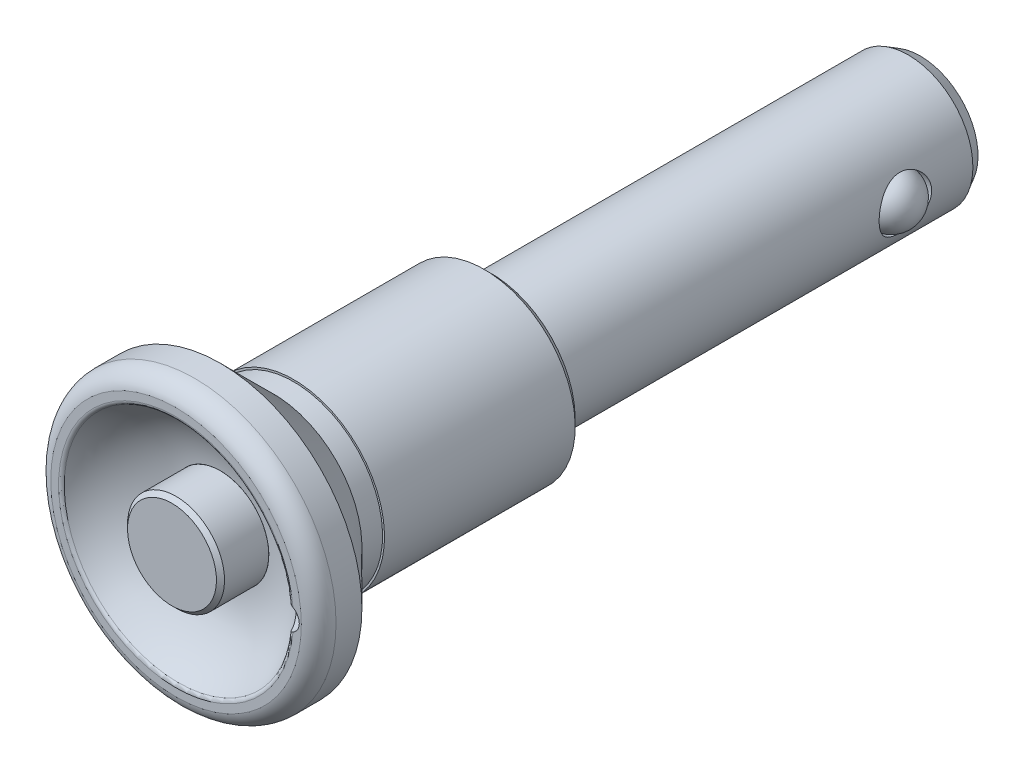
ISO-10303-21;
HEADER;
FILE_DESCRIPTION(('STEP AP214'),'2;1');
FILE_NAME('part.step','',(''),(''),'','','');
FILE_SCHEMA(('AUTOMOTIVE_DESIGN { 1 0 10303 214 1 1 1 1 }'));
ENDSEC;
DATA;
#1=APPLICATION_CONTEXT('core data for automotive mechanical design processes');
#2=APPLICATION_PROTOCOL_DEFINITION('international standard','automotive_design',2000,#1);
#3=PRODUCT_CONTEXT('',#1,'mechanical');
#4=PRODUCT('Part','Part','',(#3));
#5=PRODUCT_RELATED_PRODUCT_CATEGORY('part','',(#4));
#6=PRODUCT_DEFINITION_FORMATION('','',#4);
#7=PRODUCT_DEFINITION_CONTEXT('part definition',#1,'design');
#8=PRODUCT_DEFINITION('design','',#6,#7);
#9=PRODUCT_DEFINITION_SHAPE('','',#8);
#10=(LENGTH_UNIT() NAMED_UNIT(*) SI_UNIT(.MILLI.,.METRE.));
#11=(NAMED_UNIT(*) PLANE_ANGLE_UNIT() SI_UNIT($,.RADIAN.));
#12=(NAMED_UNIT(*) SI_UNIT($,.STERADIAN.) SOLID_ANGLE_UNIT());
#13=UNCERTAINTY_MEASURE_WITH_UNIT(LENGTH_MEASURE(1.E-05),#10,'distance_accuracy_value','');
#14=(GEOMETRIC_REPRESENTATION_CONTEXT(3) GLOBAL_UNCERTAINTY_ASSIGNED_CONTEXT((#13)) GLOBAL_UNIT_ASSIGNED_CONTEXT((#10,
#11,#12)) REPRESENTATION_CONTEXT('',''));
#15=CARTESIAN_POINT('',(0.,0.,0.));
#16=DIRECTION('',(0.,0.,1.));
#17=DIRECTION('',(1.,0.,0.));
#18=AXIS2_PLACEMENT_3D('',#15,#16,#17);
#19=CARTESIAN_POINT('',(9.,0.,-43.25));
#20=DIRECTION('',(1.,0.,0.));
#21=DIRECTION('',(0.,1.,0.));
#22=AXIS2_PLACEMENT_3D('',#19,#20,#21);
#23=CYLINDRICAL_SURFACE('',#22,3.25);
#24=CARTESIAN_POINT('',(-5.63465480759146,3.25,-43.25));
#25=CARTESIAN_POINT('',(-5.63465585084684,3.24999903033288,-43.3347265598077));
#26=CARTESIAN_POINT('',(-5.63657454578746,3.24668003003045,-43.4194635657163));
#27=CARTESIAN_POINT('',(-5.64416687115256,3.23345980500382,-43.5882644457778));
#28=CARTESIAN_POINT('',(-5.64984225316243,3.22355550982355,-43.6723279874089));
#29=CARTESIAN_POINT('',(-5.67225088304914,3.1840842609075,-43.9227685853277));
#30=CARTESIAN_POINT('',(-5.6943660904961,3.14475922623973,-44.0872467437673));
#31=CARTESIAN_POINT('',(-5.7497581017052,3.04227249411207,-44.4053993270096));
#32=CARTESIAN_POINT('',(-5.78297553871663,2.97923736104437,-44.5591260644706));
#33=CARTESIAN_POINT('',(-5.85672343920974,2.83150673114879,-44.8538197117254));
#34=CARTESIAN_POINT('',(-5.89725428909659,2.74681008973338,-44.994785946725));
#35=CARTESIAN_POINT('',(-5.98514477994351,2.54998143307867,-45.2727307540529));
#36=CARTESIAN_POINT('',(-6.03279191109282,2.43616447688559,-45.4084249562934));
#37=CARTESIAN_POINT('',(-6.12722511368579,2.18783002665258,-45.6597995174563));
#38=CARTESIAN_POINT('',(-6.17401074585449,2.05330228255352,-45.7754699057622));
#39=CARTESIAN_POINT('',(-6.26521517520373,1.75630332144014,-45.9911271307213));
#40=CARTESIAN_POINT('',(-6.30926291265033,1.59256097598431,-46.0895350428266));
#41=CARTESIAN_POINT('',(-6.38629670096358,1.24823211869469,-46.2568223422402));
#42=CARTESIAN_POINT('',(-6.41928971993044,1.06765630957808,-46.3257203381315));
#43=CARTESIAN_POINT('',(-6.46842511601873,0.70838520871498,-46.426948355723));
#44=CARTESIAN_POINT('',(-6.48559839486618,0.530468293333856,-46.4615292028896));
#45=CARTESIAN_POINT('',(-6.50500792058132,0.170592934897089,-46.5005535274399));
#46=CARTESIAN_POINT('',(-6.50725319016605,-0.0113630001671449,-46.5050152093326));
#47=CARTESIAN_POINT('',(-6.49704272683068,-0.35723022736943,-46.4845439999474));
#48=CARTESIAN_POINT('',(-6.4858466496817,-0.521336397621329,-46.462129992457));
#49=CARTESIAN_POINT('',(-6.45191454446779,-0.843095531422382,-46.3930510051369));
#50=CARTESIAN_POINT('',(-6.42917765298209,-1.00074801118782,-46.3463842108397));
#51=CARTESIAN_POINT('',(-6.37385308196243,-1.30787680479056,-46.2298199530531));
#52=CARTESIAN_POINT('',(-6.3411333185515,-1.45720962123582,-46.1596096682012));
#53=CARTESIAN_POINT('',(-6.26879358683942,-1.7423345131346,-45.9983862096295));
#54=CARTESIAN_POINT('',(-6.22917114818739,-1.8781217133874,-45.907365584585));
#55=CARTESIAN_POINT('',(-6.14233091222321,-2.14598519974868,-45.6972203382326));
#56=CARTESIAN_POINT('',(-6.09474919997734,-2.27650038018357,-45.5762535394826));
#57=CARTESIAN_POINT('',(-5.99975905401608,-2.51622424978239,-45.3146223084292));
#58=CARTESIAN_POINT('',(-5.95235078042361,-2.62541658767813,-45.1739429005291));
#59=CARTESIAN_POINT('',(-5.85980562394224,-2.82622074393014,-44.8657980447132));
#60=CARTESIAN_POINT('',(-5.81500282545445,-2.91628088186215,-44.6972003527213));
#61=CARTESIAN_POINT('',(-5.75683713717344,-3.02860289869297,-44.4329042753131));
#62=CARTESIAN_POINT('',(-5.73895226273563,-3.06225341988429,-44.3428861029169));
#63=CARTESIAN_POINT('',(-5.70689630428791,-3.12158760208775,-44.1596398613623));
#64=CARTESIAN_POINT('',(-5.69272293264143,-3.14727617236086,-44.0664138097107));
#65=CARTESIAN_POINT('',(-5.66966031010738,-3.18862076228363,-43.8849536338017));
#66=CARTESIAN_POINT('',(-5.66044290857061,-3.2049073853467,-43.7969042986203));
#67=CARTESIAN_POINT('',(-5.64606365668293,-3.23017214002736,-43.6194752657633));
#68=CARTESIAN_POINT('',(-5.64089969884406,-3.23915406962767,-43.5300962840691));
#69=CARTESIAN_POINT('',(-5.63484456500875,-3.24967714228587,-43.3507836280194));
#70=CARTESIAN_POINT('',(-5.63395180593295,-3.25122104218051,-43.2608501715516));
#71=CARTESIAN_POINT('',(-5.63646392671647,-3.24686086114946,-43.0812524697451));
#72=CARTESIAN_POINT('',(-5.63986851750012,-3.24095728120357,-42.9915882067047));
#73=CARTESIAN_POINT('',(-5.65514884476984,-3.21427724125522,-42.7437015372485));
#74=CARTESIAN_POINT('',(-5.67155983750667,-3.18549325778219,-42.5865355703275));
#75=CARTESIAN_POINT('',(-5.71556614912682,-3.10582623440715,-42.2796654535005));
#76=CARTESIAN_POINT('',(-5.74316508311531,-3.05493605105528,-42.1299637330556));
#77=CARTESIAN_POINT('',(-5.80791715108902,-2.93003236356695,-41.8342513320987));
#78=CARTESIAN_POINT('',(-5.84545364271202,-2.85505691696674,-41.6887328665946));
#79=CARTESIAN_POINT('',(-5.92551444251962,-2.68494755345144,-41.4115097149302));
#80=CARTESIAN_POINT('',(-5.96804130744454,-2.58980328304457,-41.2798121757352));
#81=CARTESIAN_POINT('',(-6.0597218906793,-2.36806394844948,-41.0166221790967));
#82=CARTESIAN_POINT('',(-6.10903611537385,-2.23901784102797,-40.8872408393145));
#83=CARTESIAN_POINT('',(-6.20410028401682,-1.96026914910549,-40.6513088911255));
#84=CARTESIAN_POINT('',(-6.24984902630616,-1.81055964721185,-40.5447659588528));
#85=CARTESIAN_POINT('',(-6.33418834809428,-1.48934321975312,-40.3551748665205));
#86=CARTESIAN_POINT('',(-6.3725595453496,-1.31736733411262,-40.272816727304));
#87=CARTESIAN_POINT('',(-6.43615086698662,-0.959533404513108,-40.1390207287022));
#88=CARTESIAN_POINT('',(-6.46138252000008,-0.773687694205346,-40.0875557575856));
#89=CARTESIAN_POINT('',(-6.49401408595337,-0.411781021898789,-40.0214370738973));
#90=CARTESIAN_POINT('',(-6.50283657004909,-0.236384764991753,-40.0038414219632));
#91=CARTESIAN_POINT('',(-6.50610717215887,0.115050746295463,-39.9972911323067));
#92=CARTESIAN_POINT('',(-6.50056030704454,0.291089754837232,-40.0083264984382));
#93=CARTESIAN_POINT('',(-6.47654468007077,0.626628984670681,-40.0567749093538));
#94=CARTESIAN_POINT('',(-6.4589493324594,0.786455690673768,-40.0924062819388));
#95=CARTESIAN_POINT('',(-6.41341105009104,1.09760306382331,-40.1866353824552));
#96=CARTESIAN_POINT('',(-6.38546662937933,1.24892250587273,-40.2452364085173));
#97=CARTESIAN_POINT('',(-6.32026378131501,1.54603651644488,-40.3863521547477));
#98=CARTESIAN_POINT('',(-6.28265782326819,1.69131721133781,-40.4697832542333));
#99=CARTESIAN_POINT('',(-6.20206440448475,1.96642117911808,-40.65704730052));
#100=CARTESIAN_POINT('',(-6.15907447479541,2.09623730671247,-40.7608896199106));
#101=CARTESIAN_POINT('',(-6.06695065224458,2.35031327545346,-40.9979647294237));
#102=CARTESIAN_POINT('',(-6.01763078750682,2.47273842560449,-41.1330928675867));
#103=CARTESIAN_POINT('',(-5.92193632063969,2.69389263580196,-41.4228073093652));
#104=CARTESIAN_POINT('',(-5.87556434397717,2.79260078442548,-41.5774106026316));
#105=CARTESIAN_POINT('',(-5.81174828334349,2.92195709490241,-41.8239315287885));
#106=CARTESIAN_POINT('',(-5.7911601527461,2.96243340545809,-41.91000421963));
#107=CARTESIAN_POINT('',(-5.75300321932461,3.03586895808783,-42.0859253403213));
#108=CARTESIAN_POINT('',(-5.73543286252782,3.0688320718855,-42.175771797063));
#109=CARTESIAN_POINT('',(-5.70405555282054,3.1267666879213,-42.3583807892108));
#110=CARTESIAN_POINT('',(-5.69023892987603,3.15175875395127,-42.451135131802));
#111=CARTESIAN_POINT('',(-5.66692413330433,3.19349036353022,-42.6389664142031));
#112=CARTESIAN_POINT('',(-5.65742293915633,3.21023567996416,-42.7340416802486));
#113=CARTESIAN_POINT('',(-5.64512882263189,3.23178897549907,-42.8993457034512));
#114=CARTESIAN_POINT('',(-5.6412106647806,3.23861149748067,-42.9692357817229));
#115=CARTESIAN_POINT('',(-5.63597313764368,3.24771756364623,-43.1094148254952));
#116=CARTESIAN_POINT('',(-5.63465394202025,3.25000080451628,-43.1797038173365));
#117=CARTESIAN_POINT('',(-5.63465480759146,3.25,-43.25));
#118=B_SPLINE_CURVE_WITH_KNOTS('',3,(#24,#25,#26,#27,#28,#29,#30,#31,#32,#33,#34,#35,#36,#37,
#38,#39,#40,#41,#42,#43,#44,#45,#46,#47,#48,#49,#50,#51,#52,#53,#54,#55,#56,#57,#58,#59,#60,#61,
#62,#63,#64,#65,#66,#67,#68,#69,#70,#71,#72,#73,#74,#75,#76,#77,#78,#79,#80,#81,#82,#83,#84,#85,
#86,#87,#88,#89,#90,#91,#92,#93,#94,#95,#96,#97,#98,#99,#100,#101,#102,#103,#104,#105,#106,#107,
#108,#109,#110,#111,#112,#113,#114,#115,#116,#117),.UNSPECIFIED.,.T.,.F.,(4,2,2,2,2,2,2,2,2,2,2,
2,2,2,2,2,2,2,2,2,2,2,2,2,2,2,2,2,2,2,2,2,2,2,2,2,2,2,2,2,2,2,2,2,2,2,4),(0.,0.254102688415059,
0.508323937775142,1.01720671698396,1.52341076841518,2.02964157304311,2.5775608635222,
3.1257522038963,3.71082834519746,4.29553499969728,4.8386878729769,5.38151242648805,
5.87719988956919,6.37292444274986,6.87551542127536,7.37828663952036,7.92853225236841,
8.4791981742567,9.06474424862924,9.35763698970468,9.6503487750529,9.92001687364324,
10.1895446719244,10.4589725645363,10.7283823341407,11.2078563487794,11.6874854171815,
12.189332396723,12.6914376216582,13.2567245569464,13.8222011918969,14.4025190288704,
14.982326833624,15.5089851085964,16.0354595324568,16.5273252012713,17.0192615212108,
17.5322584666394,18.045491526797,18.6097361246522,19.1744764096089,19.4660899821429,
19.7575529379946,20.0482577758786,20.3387588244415,20.5495694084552,20.7603940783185),.UNSPECIFIED.);
#119=CARTESIAN_POINT('',(-6.04146080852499,-2.41093054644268,-45.429429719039));
#120=VERTEX_POINT('',#119);
#121=CARTESIAN_POINT('',(-6.04146080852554,2.41093054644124,-45.4294297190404));
#122=VERTEX_POINT('',#121);
#123=EDGE_CURVE('E78',#120,#122,#118,.T.);
#124=ORIENTED_EDGE('',*,*,#123,.F.);
#125=CARTESIAN_POINT('',(-6.50475478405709,0.,-46.5));
#126=CARTESIAN_POINT('',(-6.50475472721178,-0.182431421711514,-46.4999918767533));
#127=CARTESIAN_POINT('',(-6.50415200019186,-0.364995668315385,-46.4845876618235));
#128=CARTESIAN_POINT('',(-6.50173100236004,-0.725096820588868,-46.4233526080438));
#129=CARTESIAN_POINT('',(-6.49991125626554,-0.902627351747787,-46.3774848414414));
#130=CARTESIAN_POINT('',(-6.49502786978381,-1.24739374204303,-46.2566336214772));
#131=CARTESIAN_POINT('',(-6.49196480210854,-1.41463430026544,-46.1816635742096));
#132=CARTESIAN_POINT('',(-6.48454055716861,-1.73409069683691,-46.0047703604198));
#133=CARTESIAN_POINT('',(-6.4801797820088,-1.88631116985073,-45.9028555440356));
#134=CARTESIAN_POINT('',(-6.47005616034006,-2.17150162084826,-45.6749545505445));
#135=CARTESIAN_POINT('',(-6.4642930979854,-2.30446863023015,-45.5489646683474));
#136=CARTESIAN_POINT('',(-6.45117895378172,-2.54740669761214,-45.2764608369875));
#137=CARTESIAN_POINT('',(-6.44382727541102,-2.65736908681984,-45.1299391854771));
#138=CARTESIAN_POINT('',(-6.42714023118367,-2.8512229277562,-44.8204831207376));
#139=CARTESIAN_POINT('',(-6.41780288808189,-2.93508818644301,-44.6575324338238));
#140=CARTESIAN_POINT('',(-6.39637595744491,-3.07415122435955,-44.3201765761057));
#141=CARTESIAN_POINT('',(-6.38429049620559,-3.12939158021,-44.1457888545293));
#142=CARTESIAN_POINT('',(-6.36213145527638,-3.1894323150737,-43.8809438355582));
#143=CARTESIAN_POINT('',(-6.35414445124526,-3.20560626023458,-43.7927604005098));
#144=CARTESIAN_POINT('',(-6.33542581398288,-3.23060141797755,-43.6156617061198));
#145=CARTESIAN_POINT('',(-6.32469468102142,-3.239423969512,-43.5267465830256));
#146=CARTESIAN_POINT('',(-6.30342598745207,-3.24711535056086,-43.3937912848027));
#147=CARTESIAN_POINT('',(-6.29549176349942,-3.24875723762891,-43.3496150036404));
#148=CARTESIAN_POINT('',(-6.27882947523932,-3.24969197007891,-43.2959956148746));
#149=CARTESIAN_POINT('',(-6.27515773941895,-3.24982305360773,-43.2853466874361));
#150=CARTESIAN_POINT('',(-6.26890017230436,-3.24992109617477,-43.2727940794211));
#151=CARTESIAN_POINT('',(-6.26755615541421,-3.24993748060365,-43.2703066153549));
#152=CARTESIAN_POINT('',(-6.26457757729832,-3.24996385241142,-43.2655076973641));
#153=CARTESIAN_POINT('',(-6.26294427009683,-3.24997386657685,-43.2631955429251));
#154=CARTESIAN_POINT('',(-6.26029966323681,-3.2499838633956,-43.2602771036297));
#155=CARTESIAN_POINT('',(-6.259503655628,-3.24998625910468,-43.2594800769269));
#156=CARTESIAN_POINT('',(-6.25780472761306,-3.24999021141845,-43.2580094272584));
#157=CARTESIAN_POINT('',(-6.25690222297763,-3.24999177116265,-43.2573353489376));
#158=CARTESIAN_POINT('',(-6.2553817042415,-3.24999365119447,-43.2564327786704));
#159=CARTESIAN_POINT('',(-6.25480452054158,-3.2499942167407,-43.2561363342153));
#160=CARTESIAN_POINT('',(-6.2536114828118,-3.2499951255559,-43.2556343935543));
#161=CARTESIAN_POINT('',(-6.25299567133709,-3.24999546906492,-43.255428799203));
#162=CARTESIAN_POINT('',(-6.25172949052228,-3.2499959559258,-43.2551293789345));
#163=CARTESIAN_POINT('',(-6.25107882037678,-3.24999609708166,-43.2550367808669));
#164=CARTESIAN_POINT('',(-6.24977202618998,-3.24999618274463,-43.2549813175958));
#165=CARTESIAN_POINT('',(-6.24911590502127,-3.24999612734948,-43.2550183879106));
#166=CARTESIAN_POINT('',(-6.24790373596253,-3.24999583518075,-43.2552035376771));
#167=CARTESIAN_POINT('',(-6.2473453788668,-3.24999562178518,-43.2553372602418));
#168=CARTESIAN_POINT('',(-6.2462549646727,-3.24999503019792,-43.2556861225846));
#169=CARTESIAN_POINT('',(-6.24572292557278,-3.24999465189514,-43.2559013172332));
#170=CARTESIAN_POINT('',(-6.24435696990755,-3.24999341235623,-43.2565561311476));
#171=CARTESIAN_POINT('',(-6.24354975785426,-3.24999239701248,-43.2570509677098));
#172=CARTESIAN_POINT('',(-6.24201857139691,-3.24998981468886,-43.2581558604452));
#173=CARTESIAN_POINT('',(-6.24129488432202,-3.24998824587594,-43.2587662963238));
#174=CARTESIAN_POINT('',(-6.23885580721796,-3.24998160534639,-43.2610537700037));
#175=CARTESIAN_POINT('',(-6.23732819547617,-3.24997485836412,-43.2629265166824));
#176=CARTESIAN_POINT('',(-6.2345385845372,-3.24995689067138,-43.2668604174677));
#177=CARTESIAN_POINT('',(-6.23327848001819,-3.24994563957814,-43.2689227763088));
#178=CARTESIAN_POINT('',(-6.22754077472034,-3.24987933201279,-43.2791362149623));
#179=CARTESIAN_POINT('',(-6.22414293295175,-3.24979089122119,-43.2878680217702));
#180=CARTESIAN_POINT('',(-6.21809518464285,-3.24953787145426,-43.3055431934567));
#181=CARTESIAN_POINT('',(-6.21544772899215,-3.24937304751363,-43.3144871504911));
#182=CARTESIAN_POINT('',(-6.20329024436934,-3.24836406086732,-43.3590059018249));
#183=CARTESIAN_POINT('',(-6.19656627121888,-3.24694993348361,-43.3953332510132));
#184=CARTESIAN_POINT('',(-6.1845227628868,-3.24287823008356,-43.4681644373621));
#185=CARTESIAN_POINT('',(-6.17920844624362,-3.24021613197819,-43.5046684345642));
#186=CARTESIAN_POINT('',(-6.1645565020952,-3.23031427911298,-43.6146776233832));
#187=CARTESIAN_POINT('',(-6.15659209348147,-3.22116857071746,-43.6882307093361));
#188=CARTESIAN_POINT('',(-6.1421364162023,-3.19786349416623,-43.8345240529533));
#189=CARTESIAN_POINT('',(-6.13564314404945,-3.18371101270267,-43.9072652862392));
#190=CARTESIAN_POINT('',(-6.11756290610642,-3.1337105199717,-44.1243002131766));
#191=CARTESIAN_POINT('',(-6.10741258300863,-3.09035068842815,-44.2670577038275));
#192=CARTESIAN_POINT('',(-6.08705596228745,-2.97250185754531,-44.5766439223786));
#193=CARTESIAN_POINT('',(-6.07734814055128,-2.89321109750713,-44.7416864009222));
#194=CARTESIAN_POINT('',(-6.06000127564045,-2.70803402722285,-45.0561997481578));
#195=CARTESIAN_POINT('',(-6.05236213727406,-2.60214894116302,-45.2056713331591));
#196=CARTESIAN_POINT('',(-6.0387139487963,-2.36675113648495,-45.484797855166));
#197=CARTESIAN_POINT('',(-6.03270506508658,-2.23723600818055,-45.6144507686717));
#198=CARTESIAN_POINT('',(-6.02211352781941,-1.95825322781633,-45.8502113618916));
#199=CARTESIAN_POINT('',(-6.01753088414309,-1.80878543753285,-45.9563188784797));
#200=CARTESIAN_POINT('',(-6.00967850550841,-1.4941417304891,-46.1419551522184));
#201=CARTESIAN_POINT('',(-6.00640873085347,-1.32896628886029,-46.2214847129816));
#202=CARTESIAN_POINT('',(-6.00112064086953,-0.987593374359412,-46.3516982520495));
#203=CARTESIAN_POINT('',(-5.99910232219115,-0.811395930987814,-46.4023823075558));
#204=CARTESIAN_POINT('',(-5.99628586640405,-0.453052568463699,-46.4734446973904));
#205=CARTESIAN_POINT('',(-5.99548726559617,-0.270908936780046,-46.4938345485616));
#206=CARTESIAN_POINT('',(-5.99509745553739,0.0942183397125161,-46.5037635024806));
#207=CARTESIAN_POINT('',(-5.99550624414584,0.277201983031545,-46.4933026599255));
#208=CARTESIAN_POINT('',(-5.99753672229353,0.638781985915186,-46.4418331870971));
#209=CARTESIAN_POINT('',(-5.99915820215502,0.817379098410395,-46.4008298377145));
#210=CARTESIAN_POINT('',(-6.00363843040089,1.16515467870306,-46.2894496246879));
#211=CARTESIAN_POINT('',(-6.00649721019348,1.33433290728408,-46.2190720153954));
#212=CARTESIAN_POINT('',(-6.01350251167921,1.65849568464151,-46.0509346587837));
#213=CARTESIAN_POINT('',(-6.0176492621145,1.81347770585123,-45.9531700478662));
#214=CARTESIAN_POINT('',(-6.02732342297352,2.1047933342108,-45.7330763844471));
#215=CARTESIAN_POINT('',(-6.03285058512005,2.24113028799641,-45.6107517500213));
#216=CARTESIAN_POINT('',(-6.04544982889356,2.49132905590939,-45.3450117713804));
#217=CARTESIAN_POINT('',(-6.05252187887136,2.60519133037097,-45.2015968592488));
#218=CARTESIAN_POINT('',(-6.06857069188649,2.8073171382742,-44.8976741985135));
#219=CARTESIAN_POINT('',(-6.07754918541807,2.89555724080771,-44.7371509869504));
#220=CARTESIAN_POINT('',(-6.09807707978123,3.04397016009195,-44.4033061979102));
#221=CARTESIAN_POINT('',(-6.10963108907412,3.10409205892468,-44.2299620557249));
#222=CARTESIAN_POINT('',(-6.13064936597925,3.17169375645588,-43.9649701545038));
#223=CARTESIAN_POINT('',(-6.1382597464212,3.19045596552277,-43.8759096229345));
#224=CARTESIAN_POINT('',(-6.15556946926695,3.22042544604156,-43.6967504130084));
#225=CARTESIAN_POINT('',(-6.16526748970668,3.23163748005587,-43.6066524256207));
#226=CARTESIAN_POINT('',(-6.18408699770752,3.24288271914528,-43.4699792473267));
#227=CARTESIAN_POINT('',(-6.19122596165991,3.24569959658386,-43.4233942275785));
#228=CARTESIAN_POINT('',(-6.20522823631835,3.24841427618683,-43.3541203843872));
#229=CARTESIAN_POINT('',(-6.21044556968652,3.24906738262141,-43.3311266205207));
#230=CARTESIAN_POINT('',(-6.22071764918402,3.24967689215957,-43.2971645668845));
#231=CARTESIAN_POINT('',(-6.22455261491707,3.24981834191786,-43.285924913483));
#232=CARTESIAN_POINT('',(-6.23115042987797,3.24992193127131,-43.2726935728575));
#233=CARTESIAN_POINT('',(-6.2325734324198,3.24993908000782,-43.2700667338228));
#234=CARTESIAN_POINT('',(-6.23574861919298,3.249966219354,-43.2650204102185));
#235=CARTESIAN_POINT('',(-6.23749823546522,3.24997626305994,-43.2625995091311));
#236=CARTESIAN_POINT('',(-6.24023323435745,3.24998546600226,-43.2597477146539));
#237=CARTESIAN_POINT('',(-6.24095037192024,3.24998741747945,-43.2590662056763));
#238=CARTESIAN_POINT('',(-6.24247036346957,3.2499906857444,-43.2578055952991));
#239=CARTESIAN_POINT('',(-6.24327303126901,3.24999200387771,-43.2572262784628));
#240=CARTESIAN_POINT('',(-6.24469100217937,3.24999372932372,-43.2563932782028));
#241=CARTESIAN_POINT('',(-6.24527994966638,3.24999429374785,-43.2560953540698));
#242=CARTESIAN_POINT('',(-6.24649738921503,3.24999519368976,-43.2555949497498));
#243=CARTESIAN_POINT('',(-6.24712582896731,3.24999552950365,-43.2553923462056));
#244=CARTESIAN_POINT('',(-6.24841731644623,3.24999599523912,-43.2551042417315));
#245=CARTESIAN_POINT('',(-6.24908067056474,3.24999612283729,-43.2550200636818));
#246=CARTESIAN_POINT('',(-6.25041071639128,3.24999617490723,-43.2549864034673));
#247=CARTESIAN_POINT('',(-6.25107740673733,3.24999609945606,-43.2550368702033));
#248=CARTESIAN_POINT('',(-6.2522960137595,3.24999576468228,-43.2552474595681));
#249=CARTESIAN_POINT('',(-6.25285091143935,3.24999553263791,-43.2553912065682));
#250=CARTESIAN_POINT('',(-6.2539333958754,3.24999490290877,-43.2557583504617));
#251=CARTESIAN_POINT('',(-6.25446096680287,3.24999450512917,-43.25598179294));
#252=CARTESIAN_POINT('',(-6.25583840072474,3.24999318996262,-43.256667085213));
#253=CARTESIAN_POINT('',(-6.256659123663,3.24999210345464,-43.2571869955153));
#254=CARTESIAN_POINT('',(-6.2582140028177,3.24998934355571,-43.2583432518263));
#255=CARTESIAN_POINT('',(-6.2589478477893,3.24998766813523,-43.2589799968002));
#256=CARTESIAN_POINT('',(-6.26145971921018,3.24998046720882,-43.2613987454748));
#257=CARTESIAN_POINT('',(-6.2630348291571,3.2499730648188,-43.2633865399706));
#258=CARTESIAN_POINT('',(-6.26590679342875,3.24995329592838,-43.2675538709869));
#259=CARTESIAN_POINT('',(-6.26720163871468,3.24994089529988,-43.269734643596));
#260=CARTESIAN_POINT('',(-6.27320326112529,3.24986641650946,-43.2807202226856));
#261=CARTESIAN_POINT('',(-6.27673982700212,3.24976552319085,-43.2901364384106));
#262=CARTESIAN_POINT('',(-6.28303094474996,3.24947572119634,-43.3091775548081));
#263=CARTESIAN_POINT('',(-6.28578309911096,3.24928654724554,-43.3188030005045));
#264=CARTESIAN_POINT('',(-6.29841795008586,3.24812694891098,-43.3667085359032));
#265=CARTESIAN_POINT('',(-6.3053838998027,3.24649816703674,-43.4057506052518));
#266=CARTESIAN_POINT('',(-6.31786268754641,3.2418065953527,-43.4839948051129));
#267=CARTESIAN_POINT('',(-6.32337031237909,3.23873876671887,-43.5231970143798));
#268=CARTESIAN_POINT('',(-6.33857182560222,3.22731083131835,-43.6414665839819));
#269=CARTESIAN_POINT('',(-6.34682941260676,3.21674112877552,-43.7205459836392));
#270=CARTESIAN_POINT('',(-6.36180806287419,3.18980788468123,-43.8776933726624));
#271=CARTESIAN_POINT('',(-6.36853100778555,3.17345150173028,-43.9557624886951));
#272=CARTESIAN_POINT('',(-6.38722831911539,3.11568291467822,-44.1883617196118));
#273=CARTESIAN_POINT('',(-6.3976986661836,3.06560179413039,-44.3409675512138));
#274=CARTESIAN_POINT('',(-6.41649095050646,2.94356822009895,-44.6369097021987));
#275=CARTESIAN_POINT('',(-6.42481661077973,2.87165414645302,-44.7802617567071));
#276=CARTESIAN_POINT('',(-6.43988100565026,2.70750791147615,-45.0548470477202));
#277=CARTESIAN_POINT('',(-6.44662026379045,2.61528247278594,-45.1860842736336));
#278=CARTESIAN_POINT('',(-6.45968563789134,2.39819149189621,-45.4510135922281));
#279=CARTESIAN_POINT('',(-6.4658208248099,2.27056101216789,-45.58246220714));
#280=CARTESIAN_POINT('',(-6.4766559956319,1.99493696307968,-45.82218121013));
#281=CARTESIAN_POINT('',(-6.48135496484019,1.84692910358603,-45.9304351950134));
#282=CARTESIAN_POINT('',(-6.4894329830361,1.53479241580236,-46.1205971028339));
#283=CARTESIAN_POINT('',(-6.49281172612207,1.37065986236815,-46.2024989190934));
#284=CARTESIAN_POINT('',(-6.49830922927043,1.03110256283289,-46.3374958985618));
#285=CARTESIAN_POINT('',(-6.50042961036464,0.855692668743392,-46.3906281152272));
#286=CARTESIAN_POINT('',(-6.5028796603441,0.565964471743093,-46.4523665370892));
#287=CARTESIAN_POINT('',(-6.50358302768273,0.453533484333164,-46.4702066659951));
#288=CARTESIAN_POINT('',(-6.50452060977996,0.227418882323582,-46.4940259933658));
#289=CARTESIAN_POINT('',(-6.5047548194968,0.113735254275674,-46.5000050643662));
#290=CARTESIAN_POINT('',(-6.50475478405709,0.,-46.5));
#291=B_SPLINE_CURVE_WITH_KNOTS('',3,(#125,#126,#127,#128,#129,#130,#131,#132,#133,#134,#135,
#136,#137,#138,#139,#140,#141,#142,#143,#144,#145,#146,#147,#148,#149,#150,#151,#152,#153,#154,
#155,#156,#157,#158,#159,#160,#161,#162,#163,#164,#165,#166,#167,#168,#169,#170,#171,#172,#173,
#174,#175,#176,#177,#178,#179,#180,#181,#182,#183,#184,#185,#186,#187,#188,#189,#190,#191,#192,
#193,#194,#195,#196,#197,#198,#199,#200,#201,#202,#203,#204,#205,#206,#207,#208,#209,#210,#211,
#212,#213,#214,#215,#216,#217,#218,#219,#220,#221,#222,#223,#224,#225,#226,#227,#228,#229,#230,
#231,#232,#233,#234,#235,#236,#237,#238,#239,#240,#241,#242,#243,#244,#245,#246,#247,#248,#249,
#250,#251,#252,#253,#254,#255,#256,#257,#258,#259,#260,#261,#262,#263,#264,#265,#266,#267,#268,
#269,#270,#271,#272,#273,#274,#275,#276,#277,#278,#279,#280,#281,#282,#283,#284,#285,#286,#287,
#288,#289,#290),.UNSPECIFIED.,.T.,.F.,(4,2,2,2,2,2,2,2,2,2,2,2,2,2,2,2,2,2,2,2,2,2,2,2,2,2,2,2,
2,2,2,2,2,2,2,2,2,2,2,2,2,2,2,2,2,2,2,2,2,2,2,2,2,2,2,2,2,2,2,2,2,2,2,2,2,2,2,2,2,2,2,2,2,2,2,2,
2,2,2,2,2,2,4),(0.,0.546878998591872,1.09442213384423,1.64171333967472,2.18883513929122,
2.73604120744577,3.28345310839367,3.83141267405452,4.37855484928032,4.64829359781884,
4.91798320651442,5.05238497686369,5.08600715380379,5.0944820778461,5.1029211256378,
5.1062935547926,5.10965322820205,5.11159396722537,5.11353260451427,5.11549212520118,
5.11745067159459,5.11916600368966,5.12088249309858,5.12370644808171,5.12653984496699,
5.13373370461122,5.14097693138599,5.16888967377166,5.19689256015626,5.30747569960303,
5.41846267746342,5.64180446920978,5.86484024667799,6.31195514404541,6.85939401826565,
7.40680769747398,7.95427723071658,8.50175055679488,9.0492073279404,9.59666263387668,
10.1439097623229,10.6911559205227,11.2383074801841,11.7854729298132,12.3327356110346,
12.8798999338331,13.427053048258,13.9747049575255,14.5233447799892,14.7970709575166,
15.0706243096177,15.2120965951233,15.2828520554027,15.3182754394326,15.3272316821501,
15.3361202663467,15.3390824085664,15.3420382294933,15.3440119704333,15.3459831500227,
15.3479761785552,15.3499684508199,15.3516812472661,15.3533950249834,15.3562927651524,
15.3592005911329,15.3667496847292,15.3743512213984,15.4043178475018,15.4343751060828,
15.5531053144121,15.6722543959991,15.9125314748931,16.1525123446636,16.6334226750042,
17.113492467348,17.5934036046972,18.1407106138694,18.6884034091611,19.2362230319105,
19.7833354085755,20.1242786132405,20.465225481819),.UNSPECIFIED.);
#292=EDGE_CURVE('E62',#122,#120,#291,.T.);
#293=ORIENTED_EDGE('',*,*,#292,.F.);
#294=EDGE_LOOP('',(#124,#293));
#295=FACE_BOUND('',#294,.T.);
#296=CARTESIAN_POINT('',(-7.31009575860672,3.25,-43.25));
#297=CARTESIAN_POINT('',(-7.31009732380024,3.24999819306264,-43.1630599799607));
#298=CARTESIAN_POINT('',(-7.31165386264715,3.24650411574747,-43.076090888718));
#299=CARTESIAN_POINT('',(-7.31782159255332,3.23257358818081,-42.9028024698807));
#300=CARTESIAN_POINT('',(-7.3224347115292,3.22213275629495,-42.8164835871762));
#301=CARTESIAN_POINT('',(-7.34068494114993,3.18046303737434,-42.5591175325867));
#302=CARTESIAN_POINT('',(-7.35873227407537,3.13888730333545,-42.3899262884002));
#303=CARTESIAN_POINT('',(-7.40417815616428,3.03010582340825,-42.0622642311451));
#304=CARTESIAN_POINT('',(-7.43153982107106,2.9630010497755,-41.903754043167));
#305=CARTESIAN_POINT('',(-7.49246721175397,2.80536216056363,-41.6002509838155));
#306=CARTESIAN_POINT('',(-7.5260312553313,2.71483439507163,-41.4552544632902));
#307=CARTESIAN_POINT('',(-7.59780469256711,2.50719740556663,-41.174284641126));
#308=CARTESIAN_POINT('',(-7.63616661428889,2.38892405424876,-41.0392107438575));
#309=CARTESIAN_POINT('',(-7.71195570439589,2.13160039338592,-40.790151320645));
#310=CARTESIAN_POINT('',(-7.74938251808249,1.99254233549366,-40.6761736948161));
#311=CARTESIAN_POINT('',(-7.82092244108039,1.69061377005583,-40.4680431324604));
#312=CARTESIAN_POINT('',(-7.85483757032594,1.52700226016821,-40.3748909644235));
#313=CARTESIAN_POINT('',(-7.91367836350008,1.18480623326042,-40.2178173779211));
#314=CARTESIAN_POINT('',(-7.93860783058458,1.00622809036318,-40.1538835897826));
#315=CARTESIAN_POINT('',(-7.97558858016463,0.648594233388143,-40.0602869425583));
#316=CARTESIAN_POINT('',(-7.98821898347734,0.470004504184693,-40.0290769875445));
#317=CARTESIAN_POINT('',(-8.00127556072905,0.109705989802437,-39.9968257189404));
#318=CARTESIAN_POINT('',(-8.00170642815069,-0.0720015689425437,-39.9957728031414));
#319=CARTESIAN_POINT('',(-7.99066355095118,-0.422169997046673,-40.0230312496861));
#320=CARTESIAN_POINT('',(-7.97987772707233,-0.590788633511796,-40.0496457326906));
#321=CARTESIAN_POINT('',(-7.94854711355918,-0.920926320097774,-40.1285888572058));
#322=CARTESIAN_POINT('',(-7.92800160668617,-1.08244484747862,-40.1809193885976));
#323=CARTESIAN_POINT('',(-7.87875951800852,-1.39673026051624,-40.3104453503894));
#324=CARTESIAN_POINT('',(-7.84994411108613,-1.54932739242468,-40.3880056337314));
#325=CARTESIAN_POINT('',(-7.78700709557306,-1.83973693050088,-40.5654420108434));
#326=CARTESIAN_POINT('',(-7.75288364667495,-1.97754418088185,-40.6653258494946));
#327=CARTESIAN_POINT('',(-7.68006213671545,-2.2443353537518,-40.8924212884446));
#328=CARTESIAN_POINT('',(-7.6412107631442,-2.37209684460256,-41.0210218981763));
#329=CARTESIAN_POINT('',(-7.56507027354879,-2.60475126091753,-41.2979515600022));
#330=CARTESIAN_POINT('',(-7.52778170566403,-2.70963621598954,-41.4462874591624));
#331=CARTESIAN_POINT('',(-7.45792668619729,-2.89648137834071,-41.7641116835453));
#332=CARTESIAN_POINT('',(-7.42553491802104,-2.97766171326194,-41.9341001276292));
#333=CARTESIAN_POINT('',(-7.37120049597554,-3.10975325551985,-42.2870012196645));
#334=CARTESIAN_POINT('',(-7.3492508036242,-3.16068485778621,-42.4699050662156));
#335=CARTESIAN_POINT('',(-7.32000769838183,-3.22780941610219,-42.8312282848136));
#336=CARTESIAN_POINT('',(-7.31188362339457,-3.24597550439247,-43.0092128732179));
#337=CARTESIAN_POINT('',(-7.30884184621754,-3.25282336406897,-43.365834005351));
#338=CARTESIAN_POINT('',(-7.31391993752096,-3.24151452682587,-43.544470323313));
#339=CARTESIAN_POINT('',(-7.33585566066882,-3.19153169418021,-43.8861339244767));
#340=CARTESIAN_POINT('',(-7.35199401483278,-3.15452692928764,-44.0494573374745));
#341=CARTESIAN_POINT('',(-7.39332962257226,-3.05638531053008,-44.3674592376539));
#342=CARTESIAN_POINT('',(-7.41852892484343,-2.99524299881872,-44.5221357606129));
#343=CARTESIAN_POINT('',(-7.47641704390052,-2.84775217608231,-44.8255746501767));
#344=CARTESIAN_POINT('',(-7.50937194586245,-2.76046786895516,-44.9738297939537));
#345=CARTESIAN_POINT('',(-7.57866264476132,-2.56411776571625,-45.2542780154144));
#346=CARTESIAN_POINT('',(-7.61499984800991,-2.4550428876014,-45.3864643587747));
#347=CARTESIAN_POINT('',(-7.69032288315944,-2.20834452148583,-45.6415580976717));
#348=CARTESIAN_POINT('',(-7.72929827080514,-2.06917373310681,-45.7629779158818));
#349=CARTESIAN_POINT('',(-7.80289864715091,-1.77151095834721,-45.980984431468));
#350=CARTESIAN_POINT('',(-7.83752340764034,-1.6130179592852,-46.0775698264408));
#351=CARTESIAN_POINT('',(-7.89867149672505,-1.28045225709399,-46.2428966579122));
#352=CARTESIAN_POINT('',(-7.9251887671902,-1.10636802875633,-46.311617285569));
#353=CARTESIAN_POINT('',(-7.9670167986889,-0.747763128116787,-46.4183263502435));
#354=CARTESIAN_POINT('',(-7.98233386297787,-0.563248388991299,-46.4563320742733));
#355=CARTESIAN_POINT('',(-7.99934332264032,-0.202353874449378,-46.4984343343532));
#356=CARTESIAN_POINT('',(-8.00187969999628,-0.0262571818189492,-46.5046318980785));
#357=CARTESIAN_POINT('',(-7.99534247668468,0.324389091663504,-46.4885273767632));
#358=CARTESIAN_POINT('',(-7.98627073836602,0.498938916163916,-46.4662298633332));
#359=CARTESIAN_POINT('',(-7.95796712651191,0.835717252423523,-46.3952733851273));
#360=CARTESIAN_POINT('',(-7.93907454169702,0.99816179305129,-46.3474934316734));
#361=CARTESIAN_POINT('',(-7.89317001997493,1.31268916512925,-46.2278639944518));
#362=CARTESIAN_POINT('',(-7.86615650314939,1.46476997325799,-46.1560098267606));
#363=CARTESIAN_POINT('',(-7.80514921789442,1.76171759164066,-45.9866698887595));
#364=CARTESIAN_POINT('',(-7.77089769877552,1.90595939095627,-45.8881831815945));
#365=CARTESIAN_POINT('',(-7.69951725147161,2.176473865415,-45.6698538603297));
#366=CARTESIAN_POINT('',(-7.66238732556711,2.30274026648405,-45.5500038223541));
#367=CARTESIAN_POINT('',(-7.58646571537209,2.54210677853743,-45.2833069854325));
#368=CARTESIAN_POINT('',(-7.54772000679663,2.65384474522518,-45.1352223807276));
#369=CARTESIAN_POINT('',(-7.47545536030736,2.85108049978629,-44.8210469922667));
#370=CARTESIAN_POINT('',(-7.44193927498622,2.93656399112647,-44.6549464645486));
#371=CARTESIAN_POINT('',(-7.39896255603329,3.04249490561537,-44.3964499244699));
#372=CARTESIAN_POINT('',(-7.38588609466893,3.07401827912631,-44.3090459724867));
#373=CARTESIAN_POINT('',(-7.36253208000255,3.12954209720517,-44.1315309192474));
#374=CARTESIAN_POINT('',(-7.35225317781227,3.15354616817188,-44.0414211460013));
#375=CARTESIAN_POINT('',(-7.33489719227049,3.19370630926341,-43.859430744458));
#376=CARTESIAN_POINT('',(-7.32781154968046,3.20988336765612,-43.7675555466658));
#377=CARTESIAN_POINT('',(-7.31707726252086,3.23427923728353,-43.5826022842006));
#378=CARTESIAN_POINT('',(-7.31342609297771,3.24250389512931,-43.4895251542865));
#379=CARTESIAN_POINT('',(-7.31058346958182,3.24890274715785,-43.3475459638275));
#380=CARTESIAN_POINT('',(-7.31009488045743,3.25000101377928,-43.2987775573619));
#381=CARTESIAN_POINT('',(-7.31009575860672,3.25,-43.25));
#382=B_SPLINE_CURVE_WITH_KNOTS('',3,(#296,#297,#298,#299,#300,#301,#302,#303,#304,#305,#306,
#307,#308,#309,#310,#311,#312,#313,#314,#315,#316,#317,#318,#319,#320,#321,#322,#323,#324,#325,
#326,#327,#328,#329,#330,#331,#332,#333,#334,#335,#336,#337,#338,#339,#340,#341,#342,#343,#344,
#345,#346,#347,#348,#349,#350,#351,#352,#353,#354,#355,#356,#357,#358,#359,#360,#361,#362,#363,
#364,#365,#366,#367,#368,#369,#370,#371,#372,#373,#374,#375,#376,#377,#378,#379,#380,#381),
.UNSPECIFIED.,.T.,.F.,(4,2,2,2,2,2,2,2,2,2,2,2,2,2,2,2,2,2,2,2,2,2,2,2,2,2,2,2,2,2,2,2,2,2,2,2,
2,2,2,2,2,2,4),(0.,0.260777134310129,0.521718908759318,1.04438772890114,1.56501043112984,
2.08549213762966,2.63385451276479,3.18242182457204,3.7534119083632,4.32416003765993,
4.86650613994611,5.40864358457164,5.91938723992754,6.43016843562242,6.94869149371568,
7.46739472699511,8.02109099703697,8.57497987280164,9.14544243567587,9.7155199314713,
10.2499491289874,10.7842080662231,11.2866605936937,11.7892267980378,12.3125257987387,
12.8360433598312,13.3996836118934,13.9633534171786,14.5274433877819,15.0912156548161,
15.6172206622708,16.1431412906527,16.6519938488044,17.1609454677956,17.6926147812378,
18.2244692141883,18.7904042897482,19.3566469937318,19.637824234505,19.9188656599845,
20.1991492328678,20.4792265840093,20.6255351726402),.UNSPECIFIED.);
#383=CARTESIAN_POINT('',(-7.31009575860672,3.25,-43.25));
#384=VERTEX_POINT('',#383);
#385=EDGE_CURVE('E69',#384,#384,#382,.T.);
#386=ORIENTED_EDGE('',*,*,#385,.F.);
#387=EDGE_LOOP('',(#386));
#388=FACE_BOUND('',#387,.T.);
#389=ADVANCED_FACE('F14',(#295,#388),#23,.F.);
#390=CARTESIAN_POINT('',(0.,0.,-53.1));
#391=DIRECTION('',(0.,0.,-1.));
#392=DIRECTION('',(0.,1.,0.));
#393=AXIS2_PLACEMENT_3D('',#390,#391,#392);
#394=CYLINDRICAL_SURFACE('',#393,3.);
#395=CARTESIAN_POINT('',(0.,0.,-47.6));
#396=DIRECTION('',(0.,0.,-1.));
#397=DIRECTION('',(0.,1.,0.));
#398=AXIS2_PLACEMENT_3D('',#395,#396,#397);
#399=CIRCLE('',#398,3.);
#400=CARTESIAN_POINT('',(0.,3.,-47.6));
#401=VERTEX_POINT('',#400);
#402=EDGE_CURVE('E9',#401,#401,#399,.T.);
#403=ORIENTED_EDGE('',*,*,#402,.F.);
#404=EDGE_LOOP('',(#403));
#405=FACE_BOUND('',#404,.T.);
#406=CARTESIAN_POINT('',(0.,0.,-53.1));
#407=DIRECTION('',(0.,0.,-1.));
#408=DIRECTION('',(0.,1.,0.));
#409=AXIS2_PLACEMENT_3D('',#406,#407,#408);
#410=CIRCLE('',#409,3.);
#411=CARTESIAN_POINT('',(0.,3.,-53.1));
#412=VERTEX_POINT('',#411);
#413=EDGE_CURVE('E307',#412,#412,#410,.T.);
#414=ORIENTED_EDGE('',*,*,#413,.T.);
#415=EDGE_LOOP('',(#414));
#416=FACE_BOUND('',#415,.T.);
#417=ADVANCED_FACE('F272',(#405,#416),#394,.F.);
#418=CARTESIAN_POINT('',(0.,0.,-53.1));
#419=DIRECTION('',(0.,0.,-1.));
#420=DIRECTION('',(0.,1.,0.));
#421=AXIS2_PLACEMENT_3D('',#418,#419,#420);
#422=CYLINDRICAL_SURFACE('',#421,8.);
#423=CARTESIAN_POINT('',(7.31009575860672,3.25,-43.25));
#424=CARTESIAN_POINT('',(7.31009732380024,3.24999819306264,-43.3369400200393));
#425=CARTESIAN_POINT('',(7.31165386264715,3.24650411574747,-43.423909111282));
#426=CARTESIAN_POINT('',(7.31782159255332,3.23257358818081,-43.5971975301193));
#427=CARTESIAN_POINT('',(7.3224347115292,3.22213275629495,-43.6835164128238));
#428=CARTESIAN_POINT('',(7.34068494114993,3.18046303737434,-43.9408824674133));
#429=CARTESIAN_POINT('',(7.35873227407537,3.13888730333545,-44.1100737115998));
#430=CARTESIAN_POINT('',(7.40417815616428,3.03010582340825,-44.4377357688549));
#431=CARTESIAN_POINT('',(7.43153982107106,2.9630010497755,-44.5962459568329));
#432=CARTESIAN_POINT('',(7.49246721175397,2.80536216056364,-44.8997490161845));
#433=CARTESIAN_POINT('',(7.5260312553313,2.71483439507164,-45.0447455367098));
#434=CARTESIAN_POINT('',(7.59780469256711,2.50719740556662,-45.325715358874));
#435=CARTESIAN_POINT('',(7.6361666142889,2.38892405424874,-45.4607892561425));
#436=CARTESIAN_POINT('',(7.7119557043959,2.13160039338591,-45.7098486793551));
#437=CARTESIAN_POINT('',(7.74938251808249,1.99254233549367,-45.823826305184));
#438=CARTESIAN_POINT('',(7.82092244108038,1.69061377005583,-46.0319568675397));
#439=CARTESIAN_POINT('',(7.85483757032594,1.52700226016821,-46.1251090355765));
#440=CARTESIAN_POINT('',(7.91367836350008,1.18480623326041,-46.2821826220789));
#441=CARTESIAN_POINT('',(7.93860783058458,1.00622809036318,-46.3461164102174));
#442=CARTESIAN_POINT('',(7.97558858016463,0.648594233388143,-46.4397130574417));
#443=CARTESIAN_POINT('',(7.98821898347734,0.470004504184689,-46.4709230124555));
#444=CARTESIAN_POINT('',(8.00127556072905,0.109705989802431,-46.5031742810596));
#445=CARTESIAN_POINT('',(8.00170642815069,-0.0720015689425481,-46.5042271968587));
#446=CARTESIAN_POINT('',(7.99066355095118,-0.422169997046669,-46.4769687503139));
#447=CARTESIAN_POINT('',(7.97987772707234,-0.590788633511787,-46.4503542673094));
#448=CARTESIAN_POINT('',(7.94854711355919,-0.920926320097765,-46.3714111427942));
#449=CARTESIAN_POINT('',(7.92800160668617,-1.08244484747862,-46.3190806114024));
#450=CARTESIAN_POINT('',(7.87875951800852,-1.39673026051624,-46.1895546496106));
#451=CARTESIAN_POINT('',(7.84994411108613,-1.54932739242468,-46.1119943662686));
#452=CARTESIAN_POINT('',(7.78700709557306,-1.83973693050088,-45.9345579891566));
#453=CARTESIAN_POINT('',(7.75288364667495,-1.97754418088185,-45.8346741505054));
#454=CARTESIAN_POINT('',(7.68006213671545,-2.2443353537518,-45.6075787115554));
#455=CARTESIAN_POINT('',(7.6412107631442,-2.37209684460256,-45.4789781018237));
#456=CARTESIAN_POINT('',(7.56507027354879,-2.60475126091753,-45.2020484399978));
#457=CARTESIAN_POINT('',(7.52778170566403,-2.70963621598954,-45.0537125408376));
#458=CARTESIAN_POINT('',(7.45792668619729,-2.89648137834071,-44.7358883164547));
#459=CARTESIAN_POINT('',(7.42553491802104,-2.97766171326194,-44.5658998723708));
#460=CARTESIAN_POINT('',(7.37120049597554,-3.10975325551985,-44.2129987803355));
#461=CARTESIAN_POINT('',(7.34925080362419,-3.16068485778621,-44.0300949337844));
#462=CARTESIAN_POINT('',(7.32000769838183,-3.22780941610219,-43.6687717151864));
#463=CARTESIAN_POINT('',(7.31188362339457,-3.24597550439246,-43.4907871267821));
#464=CARTESIAN_POINT('',(7.30884184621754,-3.25282336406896,-43.1341659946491));
#465=CARTESIAN_POINT('',(7.31391993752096,-3.24151452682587,-42.955529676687));
#466=CARTESIAN_POINT('',(7.33585566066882,-3.19153169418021,-42.6138660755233));
#467=CARTESIAN_POINT('',(7.35199401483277,-3.15452692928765,-42.4505426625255));
#468=CARTESIAN_POINT('',(7.39332962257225,-3.0563853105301,-42.1325407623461));
#469=CARTESIAN_POINT('',(7.41852892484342,-2.99524299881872,-41.9778642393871));
#470=CARTESIAN_POINT('',(7.47641704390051,-2.84775217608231,-41.6744253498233));
#471=CARTESIAN_POINT('',(7.50937194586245,-2.76046786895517,-41.5261702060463));
#472=CARTESIAN_POINT('',(7.57866264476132,-2.56411776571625,-41.2457219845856));
#473=CARTESIAN_POINT('',(7.61499984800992,-2.45504288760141,-41.1135356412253));
#474=CARTESIAN_POINT('',(7.69032288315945,-2.20834452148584,-40.8584419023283));
#475=CARTESIAN_POINT('',(7.72929827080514,-2.06917373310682,-40.7370220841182));
#476=CARTESIAN_POINT('',(7.80289864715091,-1.77151095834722,-40.519015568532));
#477=CARTESIAN_POINT('',(7.83752340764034,-1.6130179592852,-40.4224301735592));
#478=CARTESIAN_POINT('',(7.89867149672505,-1.28045225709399,-40.2571033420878));
#479=CARTESIAN_POINT('',(7.9251887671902,-1.10636802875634,-40.188382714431));
#480=CARTESIAN_POINT('',(7.96701679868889,-0.747763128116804,-40.0816736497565));
#481=CARTESIAN_POINT('',(7.98233386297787,-0.563248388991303,-40.0436679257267));
#482=CARTESIAN_POINT('',(7.99934332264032,-0.202353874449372,-40.0015656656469));
#483=CARTESIAN_POINT('',(8.00187969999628,-0.0262571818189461,-39.9953681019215));
#484=CARTESIAN_POINT('',(7.99534247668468,0.324389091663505,-40.0114726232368));
#485=CARTESIAN_POINT('',(7.98627073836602,0.498938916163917,-40.0337701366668));
#486=CARTESIAN_POINT('',(7.95796712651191,0.835717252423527,-40.1047266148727));
#487=CARTESIAN_POINT('',(7.93907454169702,0.998161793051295,-40.1525065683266));
#488=CARTESIAN_POINT('',(7.89317001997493,1.31268916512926,-40.2721360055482));
#489=CARTESIAN_POINT('',(7.86615650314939,1.46476997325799,-40.3439901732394));
#490=CARTESIAN_POINT('',(7.80514921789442,1.76171759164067,-40.5133301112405));
#491=CARTESIAN_POINT('',(7.77089769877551,1.90595939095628,-40.6118168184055));
#492=CARTESIAN_POINT('',(7.6995172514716,2.17647386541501,-40.8301461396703));
#493=CARTESIAN_POINT('',(7.66238732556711,2.30274026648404,-40.9499961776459));
#494=CARTESIAN_POINT('',(7.5864657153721,2.54210677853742,-41.2166930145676));
#495=CARTESIAN_POINT('',(7.54772000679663,2.65384474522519,-41.3647776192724));
#496=CARTESIAN_POINT('',(7.47545536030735,2.85108049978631,-41.6789530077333));
#497=CARTESIAN_POINT('',(7.44193927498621,2.93656399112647,-41.8450535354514));
#498=CARTESIAN_POINT('',(7.39896255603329,3.04249490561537,-42.1035500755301));
#499=CARTESIAN_POINT('',(7.38588609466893,3.07401827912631,-42.1909540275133));
#500=CARTESIAN_POINT('',(7.36253208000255,3.12954209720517,-42.3684690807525));
#501=CARTESIAN_POINT('',(7.35225317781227,3.15354616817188,-42.4585788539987));
#502=CARTESIAN_POINT('',(7.33489719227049,3.19370630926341,-42.640569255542));
#503=CARTESIAN_POINT('',(7.32781154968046,3.20988336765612,-42.7324444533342));
#504=CARTESIAN_POINT('',(7.31707726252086,3.23427923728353,-42.9173977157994));
#505=CARTESIAN_POINT('',(7.31342609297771,3.24250389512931,-43.0104748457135));
#506=CARTESIAN_POINT('',(7.31058346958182,3.24890274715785,-43.1524540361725));
#507=CARTESIAN_POINT('',(7.31009488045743,3.25000101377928,-43.2012224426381));
#508=CARTESIAN_POINT('',(7.31009575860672,3.25,-43.25));
#509=B_SPLINE_CURVE_WITH_KNOTS('',3,(#423,#424,#425,#426,#427,#428,#429,#430,#431,#432,#433,
#434,#435,#436,#437,#438,#439,#440,#441,#442,#443,#444,#445,#446,#447,#448,#449,#450,#451,#452,
#453,#454,#455,#456,#457,#458,#459,#460,#461,#462,#463,#464,#465,#466,#467,#468,#469,#470,#471,
#472,#473,#474,#475,#476,#477,#478,#479,#480,#481,#482,#483,#484,#485,#486,#487,#488,#489,#490,
#491,#492,#493,#494,#495,#496,#497,#498,#499,#500,#501,#502,#503,#504,#505,#506,#507,#508),
.UNSPECIFIED.,.T.,.F.,(4,2,2,2,2,2,2,2,2,2,2,2,2,2,2,2,2,2,2,2,2,2,2,2,2,2,2,2,2,2,2,2,2,2,2,2,
2,2,2,2,2,2,4),(0.,0.260777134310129,0.521718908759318,1.04438772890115,1.56501043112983,
2.08549213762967,2.63385451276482,3.18242182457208,3.75341190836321,4.32416003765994,
4.86650613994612,5.40864358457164,5.91938723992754,6.43016843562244,6.9486914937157,
7.46739472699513,8.02109099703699,8.57497987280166,9.14544243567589,9.71551993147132,
10.2499491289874,10.7842080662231,11.2866605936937,11.7892267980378,12.3125257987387,
12.8360433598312,13.3996836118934,13.9633534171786,14.5274433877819,15.0912156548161,
15.6172206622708,16.1431412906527,16.6519938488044,17.1609454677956,17.6926147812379,
18.2244692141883,18.7904042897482,19.3566469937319,19.6378242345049,19.9188656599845,
20.1991492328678,20.4792265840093,20.6255351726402),.UNSPECIFIED.);
#510=CARTESIAN_POINT('',(7.31009575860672,3.25,-43.25));
#511=VERTEX_POINT('',#510);
#512=EDGE_CURVE('E292',#511,#511,#509,.T.);
#513=ORIENTED_EDGE('',*,*,#512,.T.);
#514=EDGE_LOOP('',(#513));
#515=FACE_BOUND('',#514,.T.);
#516=CARTESIAN_POINT('',(0.,0.,-51.6));
#517=DIRECTION('',(0.,0.,-1.));
#518=DIRECTION('',(0.,1.,0.));
#519=AXIS2_PLACEMENT_3D('',#516,#517,#518);
#520=CIRCLE('',#519,8.);
#521=CARTESIAN_POINT('',(0.,8.,-51.6));
#522=VERTEX_POINT('',#521);
#523=EDGE_CURVE('E75',#522,#522,#520,.T.);
#524=ORIENTED_EDGE('',*,*,#523,.F.);
#525=EDGE_LOOP('',(#524));
#526=FACE_BOUND('',#525,.T.);
#527=ORIENTED_EDGE('',*,*,#385,.T.);
#528=EDGE_LOOP('',(#527));
#529=FACE_BOUND('',#528,.T.);
#530=CARTESIAN_POINT('',(0.,0.,0.));
#531=DIRECTION('',(0.,0.,1.));
#532=DIRECTION('',(1.,0.,0.));
#533=AXIS2_PLACEMENT_3D('',#530,#531,#532);
#534=CIRCLE('',#533,8.);
#535=CARTESIAN_POINT('',(8.,0.,0.));
#536=VERTEX_POINT('',#535);
#537=EDGE_CURVE('E81',#536,#536,#534,.T.);
#538=ORIENTED_EDGE('',*,*,#537,.F.);
#539=EDGE_LOOP('',(#538));
#540=FACE_BOUND('',#539,.T.);
#541=ADVANCED_FACE('F269',(#515,#526,#529,#540),#422,.T.);
#542=CARTESIAN_POINT('',(3.,0.,-53.1));
#543=DIRECTION('',(0.,0.,-1.));
#544=DIRECTION('',(0.,1.,0.));
#545=AXIS2_PLACEMENT_3D('',#542,#543,#544);
#546=PLANE('',#545);
#547=CARTESIAN_POINT('',(0.,0.,-53.1));
#548=DIRECTION('',(0.,0.,-1.));
#549=DIRECTION('',(0.,1.,0.));
#550=AXIS2_PLACEMENT_3D('',#547,#548,#549);
#551=CIRCLE('',#550,7.13397459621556);
#552=CARTESIAN_POINT('',(0.,7.13397459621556,-53.1));
#553=VERTEX_POINT('',#552);
#554=EDGE_CURVE('E310',#553,#553,#551,.T.);
#555=ORIENTED_EDGE('',*,*,#554,.T.);
#556=EDGE_LOOP('',(#555));
#557=FACE_BOUND('',#556,.T.);
#558=ORIENTED_EDGE('',*,*,#413,.F.);
#559=EDGE_LOOP('',(#558));
#560=FACE_BOUND('',#559,.T.);
#561=ADVANCED_FACE('F271',(#557,#560),#546,.T.);
#562=CARTESIAN_POINT('',(0.,0.,-53.1));
#563=DIRECTION('',(0.,0.,1.));
#564=DIRECTION('',(0.,-1.,0.));
#565=AXIS2_PLACEMENT_3D('',#562,#563,#564);
#566=CONICAL_SURFACE('',#565,7.13397459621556,0.523598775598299);
#567=ORIENTED_EDGE('',*,*,#523,.T.);
#568=EDGE_LOOP('',(#567));
#569=FACE_BOUND('',#568,.T.);
#570=ORIENTED_EDGE('',*,*,#554,.F.);
#571=EDGE_LOOP('',(#570));
#572=FACE_BOUND('',#571,.T.);
#573=ADVANCED_FACE('F280',(#569,#572),#566,.T.);
#574=CARTESIAN_POINT('',(5.63465480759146,3.25,-43.25));
#575=CARTESIAN_POINT('',(5.63465585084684,3.24999903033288,-43.1652734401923));
#576=CARTESIAN_POINT('',(5.63657454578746,3.24668003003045,-43.0805364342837));
#577=CARTESIAN_POINT('',(5.64416687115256,3.23345980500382,-42.9117355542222));
#578=CARTESIAN_POINT('',(5.64984225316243,3.22355550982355,-42.8276720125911));
#579=CARTESIAN_POINT('',(5.67225088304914,3.1840842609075,-42.5772314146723));
#580=CARTESIAN_POINT('',(5.6943660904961,3.14475922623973,-42.4127532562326));
#581=CARTESIAN_POINT('',(5.7497581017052,3.04227249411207,-42.0946006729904));
#582=CARTESIAN_POINT('',(5.78297553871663,2.97923736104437,-41.9408739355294));
#583=CARTESIAN_POINT('',(5.85672343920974,2.83150673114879,-41.6461802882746));
#584=CARTESIAN_POINT('',(5.89725428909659,2.74681008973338,-41.505214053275));
#585=CARTESIAN_POINT('',(5.98514477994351,2.54998143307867,-41.2272692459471));
#586=CARTESIAN_POINT('',(6.03279191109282,2.43616447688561,-41.0915750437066));
#587=CARTESIAN_POINT('',(6.12722511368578,2.1878300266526,-40.8402004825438));
#588=CARTESIAN_POINT('',(6.17401074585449,2.05330228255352,-40.7245300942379));
#589=CARTESIAN_POINT('',(6.26521517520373,1.75630332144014,-40.5088728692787));
#590=CARTESIAN_POINT('',(6.30926291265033,1.59256097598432,-40.4104649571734));
#591=CARTESIAN_POINT('',(6.38629670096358,1.2482321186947,-40.2431776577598));
#592=CARTESIAN_POINT('',(6.41928971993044,1.06765630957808,-40.1742796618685));
#593=CARTESIAN_POINT('',(6.46842511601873,0.70838520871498,-40.073051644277));
#594=CARTESIAN_POINT('',(6.48559839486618,0.53046829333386,-40.0384707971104));
#595=CARTESIAN_POINT('',(6.50500792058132,0.170592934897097,-39.9994464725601));
#596=CARTESIAN_POINT('',(6.50725319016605,-0.0113630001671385,-39.9949847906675));
#597=CARTESIAN_POINT('',(6.49704272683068,-0.357230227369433,-40.0154560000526));
#598=CARTESIAN_POINT('',(6.4858466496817,-0.521336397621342,-40.037870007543));
#599=CARTESIAN_POINT('',(6.45191454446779,-0.843095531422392,-40.1069489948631));
#600=CARTESIAN_POINT('',(6.42917765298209,-1.00074801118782,-40.1536157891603));
#601=CARTESIAN_POINT('',(6.37385308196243,-1.30787680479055,-40.2701800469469));
#602=CARTESIAN_POINT('',(6.3411333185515,-1.45720962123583,-40.3403903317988));
#603=CARTESIAN_POINT('',(6.26879358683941,-1.74233451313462,-40.5016137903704));
#604=CARTESIAN_POINT('',(6.22917114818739,-1.87812171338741,-40.592634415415));
#605=CARTESIAN_POINT('',(6.14233091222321,-2.14598519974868,-40.8027796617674));
#606=CARTESIAN_POINT('',(6.09474919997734,-2.27650038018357,-40.9237464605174));
#607=CARTESIAN_POINT('',(5.99975905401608,-2.5162242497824,-41.1853776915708));
#608=CARTESIAN_POINT('',(5.95235078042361,-2.62541658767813,-41.3260570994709));
#609=CARTESIAN_POINT('',(5.85980562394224,-2.82622074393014,-41.6342019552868));
#610=CARTESIAN_POINT('',(5.81500282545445,-2.91628088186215,-41.8027996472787));
#611=CARTESIAN_POINT('',(5.75683713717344,-3.02860289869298,-42.0670957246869));
#612=CARTESIAN_POINT('',(5.73895226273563,-3.0622534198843,-42.1571138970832));
#613=CARTESIAN_POINT('',(5.70689630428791,-3.12158760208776,-42.3403601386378));
#614=CARTESIAN_POINT('',(5.69272293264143,-3.14727617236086,-42.4335861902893));
#615=CARTESIAN_POINT('',(5.66966031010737,-3.18862076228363,-42.6150463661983));
#616=CARTESIAN_POINT('',(5.66044290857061,-3.20490738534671,-42.7030957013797));
#617=CARTESIAN_POINT('',(5.64606365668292,-3.23017214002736,-42.8805247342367));
#618=CARTESIAN_POINT('',(5.64089969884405,-3.23915406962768,-42.9699037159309));
#619=CARTESIAN_POINT('',(5.63484456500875,-3.24967714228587,-43.1492163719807));
#620=CARTESIAN_POINT('',(5.63395180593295,-3.25122104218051,-43.2391498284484));
#621=CARTESIAN_POINT('',(5.63646392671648,-3.24686086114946,-43.4187475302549));
#622=CARTESIAN_POINT('',(5.63986851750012,-3.24095728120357,-43.5084117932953));
#623=CARTESIAN_POINT('',(5.65514884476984,-3.21427724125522,-43.7562984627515));
#624=CARTESIAN_POINT('',(5.67155983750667,-3.18549325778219,-43.9134644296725));
#625=CARTESIAN_POINT('',(5.71556614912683,-3.10582623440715,-44.2203345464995));
#626=CARTESIAN_POINT('',(5.74316508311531,-3.05493605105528,-44.3700362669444));
#627=CARTESIAN_POINT('',(5.80791715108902,-2.93003236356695,-44.6657486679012));
#628=CARTESIAN_POINT('',(5.84545364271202,-2.85505691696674,-44.8112671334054));
#629=CARTESIAN_POINT('',(5.92551444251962,-2.68494755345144,-45.0884902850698));
#630=CARTESIAN_POINT('',(5.96804130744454,-2.58980328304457,-45.2201878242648));
#631=CARTESIAN_POINT('',(6.0597218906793,-2.36806394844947,-45.4833778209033));
#632=CARTESIAN_POINT('',(6.10903611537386,-2.23901784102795,-45.6127591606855));
#633=CARTESIAN_POINT('',(6.20410028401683,-1.96026914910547,-45.8486911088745));
#634=CARTESIAN_POINT('',(6.24984902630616,-1.81055964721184,-45.9552340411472));
#635=CARTESIAN_POINT('',(6.33418834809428,-1.48934321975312,-46.1448251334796));
#636=CARTESIAN_POINT('',(6.3725595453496,-1.31736733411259,-46.227183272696));
#637=CARTESIAN_POINT('',(6.43615086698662,-0.959533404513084,-46.3609792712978));
#638=CARTESIAN_POINT('',(6.46138252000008,-0.77368769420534,-46.4124442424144));
#639=CARTESIAN_POINT('',(6.49401408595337,-0.411781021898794,-46.4785629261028));
#640=CARTESIAN_POINT('',(6.50283657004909,-0.236384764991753,-46.4961585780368));
#641=CARTESIAN_POINT('',(6.50610717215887,0.115050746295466,-46.5027088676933));
#642=CARTESIAN_POINT('',(6.50056030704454,0.291089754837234,-46.4916735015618));
#643=CARTESIAN_POINT('',(6.47654468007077,0.626628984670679,-46.4432250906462));
#644=CARTESIAN_POINT('',(6.4589493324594,0.786455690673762,-46.4075937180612));
#645=CARTESIAN_POINT('',(6.41341105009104,1.09760306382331,-46.3133646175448));
#646=CARTESIAN_POINT('',(6.38546662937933,1.24892250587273,-46.2547635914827));
#647=CARTESIAN_POINT('',(6.32026378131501,1.54603651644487,-46.1136478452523));
#648=CARTESIAN_POINT('',(6.28265782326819,1.69131721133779,-46.0302167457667));
#649=CARTESIAN_POINT('',(6.20206440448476,1.96642117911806,-45.84295269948));
#650=CARTESIAN_POINT('',(6.15907447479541,2.09623730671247,-45.7391103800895));
#651=CARTESIAN_POINT('',(6.06695065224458,2.35031327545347,-45.5020352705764));
#652=CARTESIAN_POINT('',(6.01763078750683,2.47273842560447,-45.3669071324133));
#653=CARTESIAN_POINT('',(5.92193632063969,2.69389263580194,-45.0771926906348));
#654=CARTESIAN_POINT('',(5.87556434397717,2.79260078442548,-44.9225893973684));
#655=CARTESIAN_POINT('',(5.81174828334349,2.92195709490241,-44.6760684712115));
#656=CARTESIAN_POINT('',(5.7911601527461,2.96243340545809,-44.58999578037));
#657=CARTESIAN_POINT('',(5.75300321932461,3.03586895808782,-44.4140746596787));
#658=CARTESIAN_POINT('',(5.73543286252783,3.06883207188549,-44.324228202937));
#659=CARTESIAN_POINT('',(5.70405555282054,3.12676668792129,-44.1416192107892));
#660=CARTESIAN_POINT('',(5.69023892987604,3.15175875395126,-44.048864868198));
#661=CARTESIAN_POINT('',(5.66692413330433,3.19349036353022,-43.8610335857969));
#662=CARTESIAN_POINT('',(5.65742293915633,3.21023567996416,-43.7659583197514));
#663=CARTESIAN_POINT('',(5.64512882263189,3.23178897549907,-43.6006542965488));
#664=CARTESIAN_POINT('',(5.6412106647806,3.23861149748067,-43.5307642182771));
#665=CARTESIAN_POINT('',(5.63597313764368,3.24771756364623,-43.3905851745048));
#666=CARTESIAN_POINT('',(5.63465394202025,3.25000080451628,-43.3202961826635));
#667=CARTESIAN_POINT('',(5.63465480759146,3.25,-43.25));
#668=B_SPLINE_CURVE_WITH_KNOTS('',3,(#574,#575,#576,#577,#578,#579,#580,#581,#582,#583,#584,
#585,#586,#587,#588,#589,#590,#591,#592,#593,#594,#595,#596,#597,#598,#599,#600,#601,#602,#603,
#604,#605,#606,#607,#608,#609,#610,#611,#612,#613,#614,#615,#616,#617,#618,#619,#620,#621,#622,
#623,#624,#625,#626,#627,#628,#629,#630,#631,#632,#633,#634,#635,#636,#637,#638,#639,#640,#641,
#642,#643,#644,#645,#646,#647,#648,#649,#650,#651,#652,#653,#654,#655,#656,#657,#658,#659,#660,
#661,#662,#663,#664,#665,#666,#667),.UNSPECIFIED.,.T.,.F.,(4,2,2,2,2,2,2,2,2,2,2,2,2,2,2,2,2,2,
2,2,2,2,2,2,2,2,2,2,2,2,2,2,2,2,2,2,2,2,2,2,2,2,2,2,2,2,4),(0.,0.254102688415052,
0.508323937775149,1.01720671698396,1.52341076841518,2.0296415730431,2.57756086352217,
3.12575220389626,3.71082834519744,4.29553499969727,4.83868787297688,5.38151242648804,
5.87719988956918,6.37292444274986,6.87551542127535,7.37828663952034,7.92853225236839,
8.47919817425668,9.06474424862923,9.35763698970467,9.65034877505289,9.92001687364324,
10.1895446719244,10.4589725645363,10.7283823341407,11.2078563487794,11.6874854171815,
12.189332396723,12.6914376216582,13.2567245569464,13.8222011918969,14.4025190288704,
14.982326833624,15.5089851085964,16.0354595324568,16.5273252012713,17.0192615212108,
17.5322584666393,18.0454915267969,18.6097361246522,19.1744764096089,19.4660899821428,
19.7575529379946,20.0482577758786,20.3387588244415,20.5495694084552,20.7603940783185),.UNSPECIFIED.);
#669=CARTESIAN_POINT('',(6.04146080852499,2.41093054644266,-45.4294297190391));
#670=VERTEX_POINT('',#669);
#671=CARTESIAN_POINT('',(6.04146080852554,-2.41093054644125,-45.4294297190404));
#672=VERTEX_POINT('',#671);
#673=EDGE_CURVE('E71',#670,#672,#668,.T.);
#674=ORIENTED_EDGE('',*,*,#673,.F.);
#675=CARTESIAN_POINT('',(6.50475478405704,0.,-46.5));
#676=CARTESIAN_POINT('',(6.50475472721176,0.182431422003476,-46.4999918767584));
#677=CARTESIAN_POINT('',(6.50415200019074,0.364995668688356,-46.4845876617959));
#678=CARTESIAN_POINT('',(6.50173100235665,0.725096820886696,-46.4233526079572));
#679=CARTESIAN_POINT('',(6.49991125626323,0.902627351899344,-46.3774848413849));
#680=CARTESIAN_POINT('',(6.49502786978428,1.24739374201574,-46.2566336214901));
#681=CARTESIAN_POINT('',(6.49196480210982,1.41463430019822,-46.1816635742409));
#682=CARTESIAN_POINT('',(6.48454055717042,1.73409069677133,-46.004770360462));
#683=CARTESIAN_POINT('',(6.48017978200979,1.88631116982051,-45.9028555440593));
#684=CARTESIAN_POINT('',(6.47005616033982,2.17150162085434,-45.6749545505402));
#685=CARTESIAN_POINT('',(6.46429309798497,2.30446863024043,-45.5489646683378));
#686=CARTESIAN_POINT('',(6.45117895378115,2.54740669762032,-45.2764608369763));
#687=CARTESIAN_POINT('',(6.44382727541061,2.65736908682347,-45.1299391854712));
#688=CARTESIAN_POINT('',(6.42714023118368,2.85122292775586,-44.8204831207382));
#689=CARTESIAN_POINT('',(6.41780288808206,2.93508818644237,-44.657532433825));
#690=CARTESIAN_POINT('',(6.39637595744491,3.07415122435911,-44.3201765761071));
#691=CARTESIAN_POINT('',(6.38429049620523,3.12939158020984,-44.1457888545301));
#692=CARTESIAN_POINT('',(6.36213145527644,3.18943231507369,-43.8809438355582));
#693=CARTESIAN_POINT('',(6.35414445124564,3.20560626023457,-43.7927604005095));
#694=CARTESIAN_POINT('',(6.33542581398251,3.23060141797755,-43.6156617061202));
#695=CARTESIAN_POINT('',(6.32469468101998,3.23942396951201,-43.5267465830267));
#696=CARTESIAN_POINT('',(6.30342598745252,3.24711535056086,-43.3937912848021));
#697=CARTESIAN_POINT('',(6.29549176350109,3.2487572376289,-43.3496150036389));
#698=CARTESIAN_POINT('',(6.27882947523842,3.24969197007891,-43.295995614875));
#699=CARTESIAN_POINT('',(6.27515773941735,3.24982305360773,-43.285346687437));
#700=CARTESIAN_POINT('',(6.26890017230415,3.24992109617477,-43.2727940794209));
#701=CARTESIAN_POINT('',(6.26755615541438,3.24993748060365,-43.2703066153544));
#702=CARTESIAN_POINT('',(6.26457757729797,3.24996385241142,-43.2655076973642));
#703=CARTESIAN_POINT('',(6.26294427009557,3.24997386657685,-43.263195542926));
#704=CARTESIAN_POINT('',(6.26029966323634,3.2499838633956,-43.2602771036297));
#705=CARTESIAN_POINT('',(6.25950365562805,3.24998625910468,-43.2594800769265));
#706=CARTESIAN_POINT('',(6.25780472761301,3.24999021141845,-43.2580094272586));
#707=CARTESIAN_POINT('',(6.25690222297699,3.24999177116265,-43.2573353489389));
#708=CARTESIAN_POINT('',(6.25538170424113,3.24999365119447,-43.2564327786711));
#709=CARTESIAN_POINT('',(6.25480452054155,3.2499942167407,-43.2561363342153));
#710=CARTESIAN_POINT('',(6.25361148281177,3.2499951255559,-43.2556343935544));
#711=CARTESIAN_POINT('',(6.25299567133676,3.24999546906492,-43.2554287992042));
#712=CARTESIAN_POINT('',(6.25172949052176,3.2499959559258,-43.2551293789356));
#713=CARTESIAN_POINT('',(6.25107882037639,3.24999609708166,-43.2550367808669));
#714=CARTESIAN_POINT('',(6.24977202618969,3.24999618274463,-43.2549813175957));
#715=CARTESIAN_POINT('',(6.24911590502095,3.24999612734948,-43.2550183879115));
#716=CARTESIAN_POINT('',(6.24790373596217,3.24999583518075,-43.2552035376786));
#717=CARTESIAN_POINT('',(6.24734537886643,3.24999562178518,-43.255337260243));
#718=CARTESIAN_POINT('',(6.24625496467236,3.24999503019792,-43.2556861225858));
#719=CARTESIAN_POINT('',(6.24572292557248,3.24999465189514,-43.2559013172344));
#720=CARTESIAN_POINT('',(6.24435696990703,3.24999341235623,-43.2565561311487));
#721=CARTESIAN_POINT('',(6.24354975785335,3.24999239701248,-43.2570509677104));
#722=CARTESIAN_POINT('',(6.24201857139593,3.24998981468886,-43.2581558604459));
#723=CARTESIAN_POINT('',(6.24129488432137,3.24998824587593,-43.2587662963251));
#724=CARTESIAN_POINT('',(6.2388558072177,3.24998160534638,-43.2610537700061));
#725=CARTESIAN_POINT('',(6.23732819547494,3.24997485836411,-43.2629265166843));
#726=CARTESIAN_POINT('',(6.23453858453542,3.24995689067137,-43.2668604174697));
#727=CARTESIAN_POINT('',(6.23327848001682,3.24994563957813,-43.2689227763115));
#728=CARTESIAN_POINT('',(6.22754077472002,3.24987933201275,-43.2791362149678));
#729=CARTESIAN_POINT('',(6.22414293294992,3.24979089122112,-43.2878680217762));
#730=CARTESIAN_POINT('',(6.2180951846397,3.24953787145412,-43.305543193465));
#731=CARTESIAN_POINT('',(6.2154477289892,3.24937304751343,-43.3144871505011));
#732=CARTESIAN_POINT('',(6.20329024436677,3.2483640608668,-43.359005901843));
#733=CARTESIAN_POINT('',(6.19656627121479,3.24694993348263,-43.3953332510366));
#734=CARTESIAN_POINT('',(6.18452276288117,3.24287823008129,-43.4681644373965));
#735=CARTESIAN_POINT('',(6.17920844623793,3.2402161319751,-43.5046684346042));
#736=CARTESIAN_POINT('',(6.16455650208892,3.23031427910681,-43.6146776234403));
#737=CARTESIAN_POINT('',(6.15659209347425,3.22116857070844,-43.6882307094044));
#738=CARTESIAN_POINT('',(6.14213641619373,3.19786349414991,-43.8345240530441));
#739=CARTESIAN_POINT('',(6.13564314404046,3.18371101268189,-43.9072652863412));
#740=CARTESIAN_POINT('',(6.11756290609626,3.13371051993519,-44.1243002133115));
#741=CARTESIAN_POINT('',(6.10741258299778,3.09035068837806,-44.2670577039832));
#742=CARTESIAN_POINT('',(6.08705596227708,2.97250185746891,-44.5766439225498));
#743=CARTESIAN_POINT('',(6.07734814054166,2.89321109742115,-44.741686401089));
#744=CARTESIAN_POINT('',(6.06000127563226,2.70803402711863,-45.0561997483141));
#745=CARTESIAN_POINT('',(6.05236213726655,2.60214894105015,-45.2056713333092));
#746=CARTESIAN_POINT('',(6.03871394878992,2.36675113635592,-45.4847978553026));
#747=CARTESIAN_POINT('',(6.03270506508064,2.237236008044,-45.6144507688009));
#748=CARTESIAN_POINT('',(6.02211352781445,1.95825322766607,-45.8502113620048));
#749=CARTESIAN_POINT('',(6.01753088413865,1.80878543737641,-45.9563188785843));
#750=CARTESIAN_POINT('',(6.00967850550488,1.49414173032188,-46.1419551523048));
#751=CARTESIAN_POINT('',(6.00640873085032,1.32896628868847,-46.2214847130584));
#752=CARTESIAN_POINT('',(6.00112064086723,0.987593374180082,-46.3516982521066));
#753=CARTESIAN_POINT('',(5.99910232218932,0.811395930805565,-46.4023823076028));
#754=CARTESIAN_POINT('',(5.99628586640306,0.453052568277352,-46.4734446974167));
#755=CARTESIAN_POINT('',(5.99548726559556,0.270908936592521,-46.4938345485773));
#756=CARTESIAN_POINT('',(5.99509745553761,-0.0942183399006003,-46.5037635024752));
#757=CARTESIAN_POINT('',(5.99550624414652,-0.27720198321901,-46.4933026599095));
#758=CARTESIAN_POINT('',(5.99753672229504,-0.638781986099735,-46.4418331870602));
#759=CARTESIAN_POINT('',(5.99915820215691,-0.817379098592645,-46.4008298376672));
#760=CARTESIAN_POINT('',(6.00363843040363,-1.16515467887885,-46.2894496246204));
#761=CARTESIAN_POINT('',(6.00649721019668,-1.33433290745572,-46.2190720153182));
#762=CARTESIAN_POINT('',(6.01350251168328,-1.65849568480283,-46.0509346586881));
#763=CARTESIAN_POINT('',(6.01764926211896,-1.81347770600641,-45.953170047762));
#764=CARTESIAN_POINT('',(6.02732342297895,-2.10479333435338,-45.7330763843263));
#765=CARTESIAN_POINT('',(6.03285058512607,-2.24113028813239,-45.6107517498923));
#766=CARTESIAN_POINT('',(6.04544982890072,-2.49132905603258,-45.3450117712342));
#767=CARTESIAN_POINT('',(6.05252187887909,-2.60519133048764,-45.2015968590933));
#768=CARTESIAN_POINT('',(6.06857069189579,-2.80731713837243,-44.8976741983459));
#769=CARTESIAN_POINT('',(6.07754918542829,-2.89555724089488,-44.7371509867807));
#770=CARTESIAN_POINT('',(6.09807707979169,-3.04397016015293,-44.4033061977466));
#771=CARTESIAN_POINT('',(6.10963108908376,-3.10409205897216,-44.2299620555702));
#772=CARTESIAN_POINT('',(6.13064936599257,-3.1716937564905,-43.9649701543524));
#773=CARTESIAN_POINT('',(6.13825974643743,-3.19045596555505,-43.8759096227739));
#774=CARTESIAN_POINT('',(6.1555694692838,-3.22042544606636,-43.6967504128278));
#775=CARTESIAN_POINT('',(6.16526748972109,-3.23163748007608,-43.6066524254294));
#776=CARTESIAN_POINT('',(6.18408699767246,-3.24288271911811,-43.4699792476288));
#777=CARTESIAN_POINT('',(6.19122596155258,-3.24569959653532,-43.4233942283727));
#778=CARTESIAN_POINT('',(6.2052282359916,-3.24841427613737,-43.3541203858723));
#779=CARTESIAN_POINT('',(6.21044556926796,-3.24906738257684,-43.3311266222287));
#780=CARTESIAN_POINT('',(6.22071764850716,-3.24967689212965,-43.2971645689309));
#781=CARTESIAN_POINT('',(6.22455261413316,-3.24981834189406,-43.2859249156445));
#782=CARTESIAN_POINT('',(6.23115042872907,-3.2499219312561,-43.2726935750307));
#783=CARTESIAN_POINT('',(6.23257343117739,-3.24993907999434,-43.2700667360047));
#784=CARTESIAN_POINT('',(6.23574861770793,-3.24996621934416,-43.2650204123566));
#785=CARTESIAN_POINT('',(6.23749823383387,-3.24997626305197,-43.2625995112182));
#786=CARTESIAN_POINT('',(6.2402332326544,-3.24998546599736,-43.2597477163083));
#787=CARTESIAN_POINT('',(6.24095037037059,-3.24998741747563,-43.2590662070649));
#788=CARTESIAN_POINT('',(6.2424703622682,-3.2499906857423,-43.2578055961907));
#789=CARTESIAN_POINT('',(6.2432730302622,-3.24999200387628,-43.2572262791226));
#790=CARTESIAN_POINT('',(6.24469100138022,-3.24999372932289,-43.2563932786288));
#791=CARTESIAN_POINT('',(6.24527994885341,-3.24999429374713,-43.2560953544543));
#792=CARTESIAN_POINT('',(6.24649738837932,-3.24999519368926,-43.2555949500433));
#793=CARTESIAN_POINT('',(6.24712582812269,-3.24999552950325,-43.2553923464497));
#794=CARTESIAN_POINT('',(6.24841731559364,-3.24999599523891,-43.2551042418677));
#795=CARTESIAN_POINT('',(6.24908066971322,-3.24999612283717,-43.2550200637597));
#796=CARTESIAN_POINT('',(6.2504107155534,-3.24999617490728,-43.2549864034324));
#797=CARTESIAN_POINT('',(6.251077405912,-3.24999609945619,-43.2550368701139));
#798=CARTESIAN_POINT('',(6.25229601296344,-3.24999576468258,-43.2552474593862));
#799=CARTESIAN_POINT('',(6.25285091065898,-3.24999553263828,-43.2553912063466));
#800=CARTESIAN_POINT('',(6.25393339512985,-3.24999490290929,-43.2557583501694));
#801=CARTESIAN_POINT('',(6.25446096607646,-3.24999450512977,-43.2559817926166));
#802=CARTESIAN_POINT('',(6.25583839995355,-3.24999318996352,-43.2566670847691));
#803=CARTESIAN_POINT('',(6.25665912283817,-3.24999210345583,-43.2571869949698));
#804=CARTESIAN_POINT('',(6.25821400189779,-3.24998934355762,-43.2583432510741));
#805=CARTESIAN_POINT('',(6.25894784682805,-3.24998766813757,-43.2589799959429));
#806=CARTESIAN_POINT('',(6.26145971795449,-3.24998046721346,-43.2613987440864));
#807=CARTESIAN_POINT('',(6.26303482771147,-3.24997306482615,-43.263386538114));
#808=CARTESIAN_POINT('',(6.26590679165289,-3.24995329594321,-43.2675538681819));
#809=CARTESIAN_POINT('',(6.26720163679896,-3.24994089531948,-43.269734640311));
#810=CARTESIAN_POINT('',(6.27320325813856,-3.24986641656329,-43.2807202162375));
#811=CARTESIAN_POINT('',(6.27673982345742,-3.24976552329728,-43.2901364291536));
#812=CARTESIAN_POINT('',(6.28303094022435,-3.24947572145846,-43.3091775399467));
#813=CARTESIAN_POINT('',(6.28578309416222,-3.24928654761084,-43.3188029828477));
#814=CARTESIAN_POINT('',(6.29841794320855,-3.24812694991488,-43.3667085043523));
#815=CARTESIAN_POINT('',(6.30538389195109,-3.24649816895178,-43.405750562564));
#816=CARTESIAN_POINT('',(6.31786267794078,-3.24180659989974,-43.4839947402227));
#817=CARTESIAN_POINT('',(6.32337030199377,-3.238738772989,-43.5231969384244));
#818=CARTESIAN_POINT('',(6.33857181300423,-3.22731084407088,-43.6414664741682));
#819=CARTESIAN_POINT('',(6.34682939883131,-3.21674114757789,-43.7205458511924));
#820=CARTESIAN_POINT('',(6.36180804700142,-3.18980791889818,-43.8776931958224));
#821=CARTESIAN_POINT('',(6.36853099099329,-3.17345154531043,-43.9557622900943));
#822=CARTESIAN_POINT('',(6.38722829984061,-3.11568299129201,-44.1883614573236));
#823=CARTESIAN_POINT('',(6.39769864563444,-3.06560189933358,-44.3409672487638));
#824=CARTESIAN_POINT('',(6.41649092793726,-2.94356839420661,-44.636909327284));
#825=CARTESIAN_POINT('',(6.42481658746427,-2.87165436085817,-44.7802613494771));
#826=CARTESIAN_POINT('',(6.43988098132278,-2.7075082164,-45.0548465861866));
#827=CARTESIAN_POINT('',(6.44662023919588,-2.61528282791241,-45.1860837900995));
#828=CARTESIAN_POINT('',(6.45968561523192,-2.39819192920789,-45.4510131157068));
#829=CARTESIAN_POINT('',(6.4658208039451,-2.270561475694,-45.5824617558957));
#830=CARTESIAN_POINT('',(6.4766559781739,-1.99493747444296,-45.8221808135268));
#831=CARTESIAN_POINT('',(6.48135494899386,-1.8469296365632,-45.9304348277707));
#832=CARTESIAN_POINT('',(6.48943297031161,-1.53479298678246,-46.1205967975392));
#833=CARTESIAN_POINT('',(6.49281171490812,-1.3706604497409,-46.2024986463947));
#834=CARTESIAN_POINT('',(6.49830922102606,-1.03110317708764,-46.3374956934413));
#835=CARTESIAN_POINT('',(6.50042960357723,-0.855693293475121,-46.390627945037));
#836=CARTESIAN_POINT('',(6.50287965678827,-0.565965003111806,-46.4523664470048));
#837=CARTESIAN_POINT('',(6.50358302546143,-0.453533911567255,-46.4702066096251));
#838=CARTESIAN_POINT('',(6.50452060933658,-0.227419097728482,-46.4940259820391));
#839=CARTESIAN_POINT('',(6.50475481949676,-0.113735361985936,-46.5000050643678));
#840=CARTESIAN_POINT('',(6.50475478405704,0.,-46.5));
#841=B_SPLINE_CURVE_WITH_KNOTS('',3,(#675,#676,#677,#678,#679,#680,#681,#682,#683,#684,#685,
#686,#687,#688,#689,#690,#691,#692,#693,#694,#695,#696,#697,#698,#699,#700,#701,#702,#703,#704,
#705,#706,#707,#708,#709,#710,#711,#712,#713,#714,#715,#716,#717,#718,#719,#720,#721,#722,#723,
#724,#725,#726,#727,#728,#729,#730,#731,#732,#733,#734,#735,#736,#737,#738,#739,#740,#741,#742,
#743,#744,#745,#746,#747,#748,#749,#750,#751,#752,#753,#754,#755,#756,#757,#758,#759,#760,#761,
#762,#763,#764,#765,#766,#767,#768,#769,#770,#771,#772,#773,#774,#775,#776,#777,#778,#779,#780,
#781,#782,#783,#784,#785,#786,#787,#788,#789,#790,#791,#792,#793,#794,#795,#796,#797,#798,#799,
#800,#801,#802,#803,#804,#805,#806,#807,#808,#809,#810,#811,#812,#813,#814,#815,#816,#817,#818,
#819,#820,#821,#822,#823,#824,#825,#826,#827,#828,#829,#830,#831,#832,#833,#834,#835,#836,#837,
#838,#839,#840),.UNSPECIFIED.,.T.,.F.,(4,2,2,2,2,2,2,2,2,2,2,2,2,2,2,2,2,2,2,2,2,2,2,2,2,2,2,2,
2,2,2,2,2,2,2,2,2,2,2,2,2,2,2,2,2,2,2,2,2,2,2,2,2,2,2,2,2,2,2,2,2,2,2,2,2,2,2,2,2,2,2,2,2,2,2,2,
2,2,2,2,2,2,4),(0.,0.546878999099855,1.09442213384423,1.6417133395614,2.18883513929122,
2.7360412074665,3.28345310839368,3.83141267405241,4.37855484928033,4.64829359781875,
4.91798320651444,5.05238497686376,5.0860071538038,5.0944820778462,5.10292112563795,
5.10629355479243,5.1096532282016,5.11159396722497,5.11353260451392,5.11549212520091,
5.11745067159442,5.11916600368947,5.12088249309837,5.12370644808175,5.12653984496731,
5.13373370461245,5.14097693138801,5.16888967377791,5.19689256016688,5.3074756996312,
5.41846267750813,5.64180446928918,5.86484024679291,6.31195514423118,6.8593940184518,
7.40680769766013,7.95427723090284,8.50175055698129,9.04920732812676,9.59666263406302,
10.1439097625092,10.691155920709,11.2383074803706,11.7854729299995,12.3327356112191,
12.8798999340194,13.4270530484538,13.974704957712,14.5233447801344,14.797070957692,
15.0706243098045,15.2120965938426,15.2828520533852,15.3182754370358,15.3272316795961,
15.3361202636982,15.3390824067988,15.3420382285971,15.3440119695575,15.3459831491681,
15.3479761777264,15.3499684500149,15.351681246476,15.3533950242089,15.3562927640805,
15.3592005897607,15.3667496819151,15.3743512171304,15.4043178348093,15.434375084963,
15.5531052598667,15.6722543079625,15.9125313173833,16.1525121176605,16.6334223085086,
17.1134919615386,17.5934029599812,18.1407099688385,18.688402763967,19.2362223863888,
19.7833347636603,20.12427829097,20.4652254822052),.UNSPECIFIED.);
#842=EDGE_CURVE('E32',#672,#670,#841,.T.);
#843=ORIENTED_EDGE('',*,*,#842,.F.);
#844=EDGE_LOOP('',(#674,#843));
#845=FACE_BOUND('',#844,.T.);
#846=ORIENTED_EDGE('',*,*,#512,.F.);
#847=EDGE_LOOP('',(#846));
#848=FACE_BOUND('',#847,.T.);
#849=ADVANCED_FACE('F72',(#845,#848),#23,.F.);
#850=CARTESIAN_POINT('',(6.25,0.,-43.26));
#851=DIRECTION('',(0.,0.,-1.));
#852=DIRECTION('',(-1.,0.,0.));
#853=AXIS2_PLACEMENT_3D('',#850,#851,#852);
#854=SPHERICAL_SURFACE('',#853,3.25);
#855=CARTESIAN_POINT('',(6.50475478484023,0.,-40.019999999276));
#856=CARTESIAN_POINT('',(6.50474566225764,0.171530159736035,-40.0200071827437));
#857=CARTESIAN_POINT('',(6.49790260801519,0.343237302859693,-40.0331353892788));
#858=CARTESIAN_POINT('',(6.47116293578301,0.681788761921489,-40.0853570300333));
#859=CARTESIAN_POINT('',(6.45124479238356,0.848624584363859,-40.1244932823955));
#860=CARTESIAN_POINT('',(6.40034783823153,1.17224309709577,-40.2276483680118));
#861=CARTESIAN_POINT('',(6.36939154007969,1.32904548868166,-40.2916165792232));
#862=CARTESIAN_POINT('',(6.29938457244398,1.62890160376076,-40.44287880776));
#863=CARTESIAN_POINT('',(6.26033549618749,1.7719580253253,-40.5301682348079));
#864=CARTESIAN_POINT('',(6.17674720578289,2.04462778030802,-40.7286784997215));
#865=CARTESIAN_POINT('',(6.13209177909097,2.17379569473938,-40.8404617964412));
#866=CARTESIAN_POINT('',(6.04254347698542,2.41157186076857,-41.0840466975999));
#867=CARTESIAN_POINT('',(5.99765054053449,2.52017453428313,-41.2158537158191));
#868=CARTESIAN_POINT('',(5.91062505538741,2.71817712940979,-41.5015717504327));
#869=CARTESIAN_POINT('',(5.86864902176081,2.80674969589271,-41.6561054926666));
#870=CARTESIAN_POINT('',(5.79402267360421,2.95774751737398,-41.9795482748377));
#871=CARTESIAN_POINT('',(5.76137156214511,3.02017500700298,-42.1484560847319));
#872=CARTESIAN_POINT('',(5.70953727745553,3.11705476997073,-42.4939426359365));
#873=CARTESIAN_POINT('',(5.69020189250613,3.15182394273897,-42.6704093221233));
#874=CARTESIAN_POINT('',(5.66672073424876,3.19385550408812,-43.0275648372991));
#875=CARTESIAN_POINT('',(5.66257131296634,3.20112449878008,-43.2082526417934));
#876=CARTESIAN_POINT('',(5.66982510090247,3.18825201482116,-43.56196459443));
#877=CARTESIAN_POINT('',(5.6806889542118,3.16906116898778,-43.7350355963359));
#878=CARTESIAN_POINT('',(5.71577560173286,3.1053260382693,-44.0750321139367));
#879=CARTESIAN_POINT('',(5.73999891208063,3.06078077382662,-44.2419573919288));
#880=CARTESIAN_POINT('',(5.79925881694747,2.94695341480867,-44.5658591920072));
#881=CARTESIAN_POINT('',(5.83433869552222,2.87757212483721,-44.7227928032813));
#882=CARTESIAN_POINT('',(5.91156442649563,2.71537871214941,-45.0221473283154));
#883=CARTESIAN_POINT('',(5.95371168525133,2.62256192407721,-45.1645653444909));
#884=CARTESIAN_POINT('',(6.04237352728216,2.41145167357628,-45.4364659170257));
#885=CARTESIAN_POINT('',(6.08899086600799,2.29235915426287,-45.5652955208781));
#886=CARTESIAN_POINT('',(6.18030415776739,2.03334758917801,-45.8008407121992));
#887=CARTESIAN_POINT('',(6.22499996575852,1.89342697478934,-45.9075546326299));
#888=CARTESIAN_POINT('',(6.30804041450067,1.59515991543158,-46.0968478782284));
#889=CARTESIAN_POINT('',(6.34634641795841,1.43671058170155,-46.1792825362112));
#890=CARTESIAN_POINT('',(6.41218920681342,1.10634032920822,-46.3170082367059));
#891=CARTESIAN_POINT('',(6.43972871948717,0.93442283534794,-46.3723061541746));
#892=CARTESIAN_POINT('',(6.48024995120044,0.589236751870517,-46.4526228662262));
#893=CARTESIAN_POINT('',(6.49376220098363,0.416287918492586,-46.478748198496));
#894=CARTESIAN_POINT('',(6.50673311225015,0.0679236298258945,-46.5038397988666));
#895=CARTESIAN_POINT('',(6.50619477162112,-0.107491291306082,-46.5028118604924));
#896=CARTESIAN_POINT('',(6.49138330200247,-0.449586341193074,-46.4741312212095));
#897=CARTESIAN_POINT('',(6.477570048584,-0.616362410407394,-46.4473699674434));
#898=CARTESIAN_POINT('',(6.4381980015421,-0.942571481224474,-46.3692054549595));
#899=CARTESIAN_POINT('',(6.41263902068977,-1.10200436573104,-46.3178018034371));
#900=CARTESIAN_POINT('',(6.35184199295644,-1.4110349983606,-46.1909114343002));
#901=CARTESIAN_POINT('',(6.31650314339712,-1.56050902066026,-46.1151725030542));
#902=CARTESIAN_POINT('',(6.23958749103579,-1.84418291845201,-45.9415166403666));
#903=CARTESIAN_POINT('',(6.19800936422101,-1.97837954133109,-45.8435949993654));
#904=CARTESIAN_POINT('',(6.11066204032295,-2.23398091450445,-45.623067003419));
#905=CARTESIAN_POINT('',(6.06478974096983,-2.35459656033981,-45.4995863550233));
#906=CARTESIAN_POINT('',(5.97514242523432,-2.57362549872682,-45.2336030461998));
#907=CARTESIAN_POINT('',(5.93136783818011,-2.67203426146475,-45.0910965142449));
#908=CARTESIAN_POINT('',(5.84944040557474,-2.84701497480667,-44.7864145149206));
#909=CARTESIAN_POINT('',(5.81146645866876,-2.92294192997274,-44.6238191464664));
#910=CARTESIAN_POINT('',(5.74696269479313,-3.04782474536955,-44.2864506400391));
#911=CARTESIAN_POINT('',(5.72043073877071,-3.09678564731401,-44.1116797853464));
#912=CARTESIAN_POINT('',(5.68245540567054,-3.16592357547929,-43.7591836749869));
#913=CARTESIAN_POINT('',(5.67067724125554,-3.18674014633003,-43.5816202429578));
#914=CARTESIAN_POINT('',(5.66250356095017,-3.20124483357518,-43.2250517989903));
#915=CARTESIAN_POINT('',(5.66610532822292,-3.1949377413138,-43.0460470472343));
#916=CARTESIAN_POINT('',(5.68791496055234,-3.15593342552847,-42.6972976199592));
#917=CARTESIAN_POINT('',(5.70568508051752,-3.12402693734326,-42.5274358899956));
#918=CARTESIAN_POINT('',(5.7533019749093,-3.03543366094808,-42.1960850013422));
#919=CARTESIAN_POINT('',(5.78314994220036,-2.97874442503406,-42.0345966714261));
#920=CARTESIAN_POINT('',(5.85230010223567,-2.84050312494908,-41.7215438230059));
#921=CARTESIAN_POINT('',(5.89174923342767,-2.7585587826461,-41.570185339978));
#922=CARTESIAN_POINT('',(5.9756844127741,-2.57167178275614,-41.2839584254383));
#923=CARTESIAN_POINT('',(6.02017120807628,-2.46672571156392,-41.1490924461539));
#924=CARTESIAN_POINT('',(6.11120605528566,-2.23189542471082,-40.8946242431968));
#925=CARTESIAN_POINT('',(6.15777266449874,-2.10128281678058,-40.7756993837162));
#926=CARTESIAN_POINT('',(6.24654956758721,-1.82046795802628,-40.5615680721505));
#927=CARTESIAN_POINT('',(6.28875837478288,-1.67025906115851,-40.4663696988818));
#928=CARTESIAN_POINT('',(6.36406322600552,-1.35520718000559,-40.302699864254));
#929=CARTESIAN_POINT('',(6.39722001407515,-1.19047207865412,-40.234048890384));
#930=CARTESIAN_POINT('',(6.45122168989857,-0.850333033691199,-40.1244818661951));
#931=CARTESIAN_POINT('',(6.47209119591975,-0.674951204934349,-40.0835103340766));
#932=CARTESIAN_POINT('',(6.49203204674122,-0.414968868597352,-40.0446177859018));
#933=CARTESIAN_POINT('',(6.49678998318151,-0.332330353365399,-40.035394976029));
#934=CARTESIAN_POINT('',(6.50315356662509,-0.166475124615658,-40.0230843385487));
#935=CARTESIAN_POINT('',(6.50475921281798,-0.0832584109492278,-40.0199965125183));
#936=CARTESIAN_POINT('',(6.50475478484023,0.,-40.019999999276));
#937=B_SPLINE_CURVE_WITH_KNOTS('',3,(#855,#856,#857,#858,#859,#860,#861,#862,#863,#864,#865,
#866,#867,#868,#869,#870,#871,#872,#873,#874,#875,#876,#877,#878,#879,#880,#881,#882,#883,#884,
#885,#886,#887,#888,#889,#890,#891,#892,#893,#894,#895,#896,#897,#898,#899,#900,#901,#902,#903,
#904,#905,#906,#907,#908,#909,#910,#911,#912,#913,#914,#915,#916,#917,#918,#919,#920,#921,#922,
#923,#924,#925,#926,#927,#928,#929,#930,#931,#932,#933,#934,#935,#936),.UNSPECIFIED.,.T.,.F.,(4,
2,2,2,2,2,2,2,2,2,2,2,2,2,2,2,2,2,2,2,2,2,2,2,2,2,2,2,2,2,2,2,2,2,2,2,2,2,2,2,4),(0.,
0.514269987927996,1.02938874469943,1.54346285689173,2.05743585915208,2.58475228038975,
3.11221152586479,3.65856763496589,4.2048770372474,4.74483303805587,5.2846593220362,
5.80558825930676,6.32653732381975,6.84959071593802,7.37274831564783,7.9148005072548,
8.45689354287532,9.0021541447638,9.54727653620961,10.0709340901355,10.5944799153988,
11.1005190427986,11.6065662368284,12.1180371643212,12.6296167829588,13.1630031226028,
13.6964981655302,14.2440758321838,14.7915510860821,15.326363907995,15.8610822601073,
16.3798918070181,16.8987526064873,17.4261176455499,17.9535610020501,18.4989911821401,
19.0446068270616,19.5864656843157,20.1272351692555,20.3768547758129,20.6264744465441),.UNSPECIFIED.);
#938=EDGE_CURVE('E67',#672,#670,#937,.T.);
#939=ORIENTED_EDGE('',*,*,#938,.F.);
#940=ORIENTED_EDGE('',*,*,#842,.T.);
#941=EDGE_LOOP('',(#939,#940));
#942=FACE_BOUND('',#941,.T.);
#943=ADVANCED_FACE('F65',(#942),#854,.T.);
#944=CARTESIAN_POINT('',(-6.25,0.,-43.26));
#945=DIRECTION('',(0.,0.,1.));
#946=DIRECTION('',(-1.,0.,0.));
#947=AXIS2_PLACEMENT_3D('',#944,#945,#946);
#948=SPHERICAL_SURFACE('',#947,3.25);
#949=CARTESIAN_POINT('',(-6.50475478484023,0.,-40.019999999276));
#950=CARTESIAN_POINT('',(-6.50474566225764,-0.171530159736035,-40.0200071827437));
#951=CARTESIAN_POINT('',(-6.49790260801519,-0.343237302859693,-40.0331353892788));
#952=CARTESIAN_POINT('',(-6.47116293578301,-0.681788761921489,-40.0853570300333));
#953=CARTESIAN_POINT('',(-6.45124479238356,-0.848624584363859,-40.1244932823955));
#954=CARTESIAN_POINT('',(-6.40034783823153,-1.17224309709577,-40.2276483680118));
#955=CARTESIAN_POINT('',(-6.36939154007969,-1.32904548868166,-40.2916165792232));
#956=CARTESIAN_POINT('',(-6.29938457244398,-1.62890160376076,-40.44287880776));
#957=CARTESIAN_POINT('',(-6.26033549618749,-1.7719580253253,-40.5301682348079));
#958=CARTESIAN_POINT('',(-6.17674720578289,-2.04462778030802,-40.7286784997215));
#959=CARTESIAN_POINT('',(-6.13209177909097,-2.17379569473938,-40.8404617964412));
#960=CARTESIAN_POINT('',(-6.04254347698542,-2.41157186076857,-41.0840466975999));
#961=CARTESIAN_POINT('',(-5.99765054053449,-2.52017453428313,-41.2158537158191));
#962=CARTESIAN_POINT('',(-5.91062505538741,-2.71817712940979,-41.5015717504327));
#963=CARTESIAN_POINT('',(-5.86864902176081,-2.80674969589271,-41.6561054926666));
#964=CARTESIAN_POINT('',(-5.79402267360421,-2.95774751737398,-41.9795482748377));
#965=CARTESIAN_POINT('',(-5.76137156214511,-3.02017500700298,-42.1484560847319));
#966=CARTESIAN_POINT('',(-5.70953727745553,-3.11705476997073,-42.4939426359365));
#967=CARTESIAN_POINT('',(-5.69020189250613,-3.15182394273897,-42.6704093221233));
#968=CARTESIAN_POINT('',(-5.66672073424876,-3.19385550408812,-43.0275648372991));
#969=CARTESIAN_POINT('',(-5.66257131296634,-3.20112449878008,-43.2082526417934));
#970=CARTESIAN_POINT('',(-5.66982510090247,-3.18825201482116,-43.56196459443));
#971=CARTESIAN_POINT('',(-5.6806889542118,-3.16906116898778,-43.7350355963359));
#972=CARTESIAN_POINT('',(-5.71577560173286,-3.1053260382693,-44.0750321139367));
#973=CARTESIAN_POINT('',(-5.73999891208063,-3.06078077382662,-44.2419573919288));
#974=CARTESIAN_POINT('',(-5.79925881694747,-2.94695341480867,-44.5658591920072));
#975=CARTESIAN_POINT('',(-5.83433869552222,-2.87757212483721,-44.7227928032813));
#976=CARTESIAN_POINT('',(-5.91156442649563,-2.71537871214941,-45.0221473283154));
#977=CARTESIAN_POINT('',(-5.95371168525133,-2.62256192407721,-45.1645653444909));
#978=CARTESIAN_POINT('',(-6.04237352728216,-2.41145167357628,-45.4364659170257));
#979=CARTESIAN_POINT('',(-6.08899086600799,-2.29235915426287,-45.5652955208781));
#980=CARTESIAN_POINT('',(-6.18030415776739,-2.03334758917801,-45.8008407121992));
#981=CARTESIAN_POINT('',(-6.22499996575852,-1.89342697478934,-45.9075546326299));
#982=CARTESIAN_POINT('',(-6.30804041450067,-1.59515991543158,-46.0968478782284));
#983=CARTESIAN_POINT('',(-6.34634641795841,-1.43671058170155,-46.1792825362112));
#984=CARTESIAN_POINT('',(-6.41218920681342,-1.10634032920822,-46.3170082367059));
#985=CARTESIAN_POINT('',(-6.43972871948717,-0.93442283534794,-46.3723061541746));
#986=CARTESIAN_POINT('',(-6.48024995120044,-0.589236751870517,-46.4526228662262));
#987=CARTESIAN_POINT('',(-6.49376220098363,-0.416287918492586,-46.478748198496));
#988=CARTESIAN_POINT('',(-6.50673311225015,-0.0679236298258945,-46.5038397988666));
#989=CARTESIAN_POINT('',(-6.50619477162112,0.107491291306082,-46.5028118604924));
#990=CARTESIAN_POINT('',(-6.49138330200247,0.449586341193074,-46.4741312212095));
#991=CARTESIAN_POINT('',(-6.477570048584,0.616362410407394,-46.4473699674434));
#992=CARTESIAN_POINT('',(-6.4381980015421,0.942571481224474,-46.3692054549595));
#993=CARTESIAN_POINT('',(-6.41263902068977,1.10200436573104,-46.3178018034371));
#994=CARTESIAN_POINT('',(-6.35184199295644,1.4110349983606,-46.1909114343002));
#995=CARTESIAN_POINT('',(-6.31650314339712,1.56050902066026,-46.1151725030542));
#996=CARTESIAN_POINT('',(-6.23958749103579,1.84418291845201,-45.9415166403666));
#997=CARTESIAN_POINT('',(-6.19800936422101,1.97837954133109,-45.8435949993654));
#998=CARTESIAN_POINT('',(-6.11066204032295,2.23398091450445,-45.623067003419));
#999=CARTESIAN_POINT('',(-6.06478974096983,2.35459656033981,-45.4995863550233));
#1000=CARTESIAN_POINT('',(-5.97514242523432,2.57362549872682,-45.2336030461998));
#1001=CARTESIAN_POINT('',(-5.93136783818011,2.67203426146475,-45.0910965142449));
#1002=CARTESIAN_POINT('',(-5.84944040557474,2.84701497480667,-44.7864145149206));
#1003=CARTESIAN_POINT('',(-5.81146645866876,2.92294192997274,-44.6238191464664));
#1004=CARTESIAN_POINT('',(-5.74696269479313,3.04782474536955,-44.2864506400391));
#1005=CARTESIAN_POINT('',(-5.72043073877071,3.09678564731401,-44.1116797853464));
#1006=CARTESIAN_POINT('',(-5.68245540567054,3.16592357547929,-43.7591836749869));
#1007=CARTESIAN_POINT('',(-5.67067724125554,3.18674014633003,-43.5816202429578));
#1008=CARTESIAN_POINT('',(-5.66250356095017,3.20124483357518,-43.2250517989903));
#1009=CARTESIAN_POINT('',(-5.66610532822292,3.1949377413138,-43.0460470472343));
#1010=CARTESIAN_POINT('',(-5.68791496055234,3.15593342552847,-42.6972976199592));
#1011=CARTESIAN_POINT('',(-5.70568508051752,3.12402693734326,-42.5274358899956));
#1012=CARTESIAN_POINT('',(-5.7533019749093,3.03543366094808,-42.1960850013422));
#1013=CARTESIAN_POINT('',(-5.78314994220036,2.97874442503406,-42.0345966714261));
#1014=CARTESIAN_POINT('',(-5.85230010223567,2.84050312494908,-41.7215438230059));
#1015=CARTESIAN_POINT('',(-5.89174923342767,2.7585587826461,-41.570185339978));
#1016=CARTESIAN_POINT('',(-5.9756844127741,2.57167178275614,-41.2839584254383));
#1017=CARTESIAN_POINT('',(-6.02017120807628,2.46672571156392,-41.1490924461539));
#1018=CARTESIAN_POINT('',(-6.11120605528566,2.23189542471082,-40.8946242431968));
#1019=CARTESIAN_POINT('',(-6.15777266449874,2.10128281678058,-40.7756993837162));
#1020=CARTESIAN_POINT('',(-6.24654956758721,1.82046795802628,-40.5615680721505));
#1021=CARTESIAN_POINT('',(-6.28875837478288,1.67025906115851,-40.4663696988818));
#1022=CARTESIAN_POINT('',(-6.36406322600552,1.35520718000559,-40.302699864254));
#1023=CARTESIAN_POINT('',(-6.39722001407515,1.19047207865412,-40.234048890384));
#1024=CARTESIAN_POINT('',(-6.45122168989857,0.850333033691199,-40.1244818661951));
#1025=CARTESIAN_POINT('',(-6.47209119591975,0.674951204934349,-40.0835103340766));
#1026=CARTESIAN_POINT('',(-6.49203204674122,0.414968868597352,-40.0446177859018));
#1027=CARTESIAN_POINT('',(-6.49678998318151,0.332330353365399,-40.035394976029));
#1028=CARTESIAN_POINT('',(-6.50315356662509,0.166475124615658,-40.0230843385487));
#1029=CARTESIAN_POINT('',(-6.50475921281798,0.0832584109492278,-40.0199965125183));
#1030=CARTESIAN_POINT('',(-6.50475478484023,0.,-40.019999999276));
#1031=B_SPLINE_CURVE_WITH_KNOTS('',3,(#949,#950,#951,#952,#953,#954,#955,#956,#957,#958,#959,
#960,#961,#962,#963,#964,#965,#966,#967,#968,#969,#970,#971,#972,#973,#974,#975,#976,#977,#978,
#979,#980,#981,#982,#983,#984,#985,#986,#987,#988,#989,#990,#991,#992,#993,#994,#995,#996,#997,
#998,#999,#1000,#1001,#1002,#1003,#1004,#1005,#1006,#1007,#1008,#1009,#1010,#1011,#1012,#1013,
#1014,#1015,#1016,#1017,#1018,#1019,#1020,#1021,#1022,#1023,#1024,#1025,#1026,#1027,#1028,#1029,
#1030),.UNSPECIFIED.,.T.,.F.,(4,2,2,2,2,2,2,2,2,2,2,2,2,2,2,2,2,2,2,2,2,2,2,2,2,2,2,2,2,2,2,2,2,
2,2,2,2,2,2,2,4),(0.,0.514269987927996,1.02938874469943,1.54346285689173,2.05743585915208,
2.58475228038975,3.11221152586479,3.65856763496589,4.2048770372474,4.74483303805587,
5.2846593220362,5.80558825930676,6.32653732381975,6.84959071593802,7.37274831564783,
7.9148005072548,8.45689354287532,9.0021541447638,9.54727653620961,10.0709340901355,
10.5944799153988,11.1005190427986,11.6065662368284,12.1180371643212,12.6296167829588,
13.1630031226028,13.6964981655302,14.2440758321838,14.7915510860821,15.326363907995,
15.8610822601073,16.3798918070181,16.8987526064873,17.4261176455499,17.9535610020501,
18.4989911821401,19.0446068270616,19.5864656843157,20.1272351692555,20.3768547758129,
20.6264744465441),.UNSPECIFIED.);
#1032=EDGE_CURVE('E24',#122,#120,#1031,.T.);
#1033=ORIENTED_EDGE('',*,*,#1032,.F.);
#1034=ORIENTED_EDGE('',*,*,#292,.T.);
#1035=EDGE_LOOP('',(#1033,#1034));
#1036=FACE_BOUND('',#1035,.T.);
#1037=ADVANCED_FACE('F102',(#1036),#948,.T.);
#1038=CARTESIAN_POINT('',(0.,0.,35.1206934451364));
#1039=DIRECTION('',(0.,0.,1.));
#1040=DIRECTION('',(0.,-1.,0.));
#1041=AXIS2_PLACEMENT_3D('',#1038,#1039,#1040);
#1042=CYLINDRICAL_SURFACE('',#1041,6.50475478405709);
#1043=ORIENTED_EDGE('',*,*,#1032,.T.);
#1044=ORIENTED_EDGE('',*,*,#123,.T.);
#1045=EDGE_LOOP('',(#1043,#1044));
#1046=FACE_BOUND('',#1045,.T.);
#1047=ADVANCED_FACE('F99',(#1046),#1042,.T.);
#1048=ORIENTED_EDGE('',*,*,#938,.T.);
#1049=ORIENTED_EDGE('',*,*,#673,.T.);
#1050=EDGE_LOOP('',(#1048,#1049));
#1051=FACE_BOUND('',#1050,.T.);
#1052=ADVANCED_FACE('F77',(#1051),#1042,.T.);
#1053=CARTESIAN_POINT('',(2.99,0.,-47.6));
#1054=DIRECTION('',(0.,0.,1.));
#1055=DIRECTION('',(0.,-1.,0.));
#1056=AXIS2_PLACEMENT_3D('',#1053,#1054,#1055);
#1057=PLANE('',#1056);
#1058=ORIENTED_EDGE('',*,*,#402,.T.);
#1059=EDGE_LOOP('',(#1058));
#1060=FACE_BOUND('',#1059,.T.);
#1061=ADVANCED_FACE('F225',(#1060),#1057,.F.);
#1062=CARTESIAN_POINT('',(0.,0.,39.5));
#1063=DIRECTION('',(0.,0.,-1.));
#1064=DIRECTION('',(0.,1.,0.));
#1065=AXIS2_PLACEMENT_3D('',#1062,#1063,#1064);
#1066=PLANE('',#1065);
#1067=CARTESIAN_POINT('',(0.,0.,39.5));
#1068=DIRECTION('',(0.,0.,-1.));
#1069=DIRECTION('',(0.,1.,0.));
#1070=AXIS2_PLACEMENT_3D('',#1067,#1068,#1069);
#1071=CIRCLE('',#1070,5.5);
#1072=CARTESIAN_POINT('',(0.,5.5,39.5));
#1073=VERTEX_POINT('',#1072);
#1074=EDGE_CURVE('E240',#1073,#1073,#1071,.T.);
#1075=ORIENTED_EDGE('',*,*,#1074,.F.);
#1076=EDGE_LOOP('',(#1075));
#1077=FACE_BOUND('',#1076,.T.);
#1078=ADVANCED_FACE('F219',(#1077),#1066,.F.);
#1079=CARTESIAN_POINT('',(0.,0.,39.5));
#1080=DIRECTION('',(0.,0.,-1.));
#1081=DIRECTION('',(0.,1.,0.));
#1082=AXIS2_PLACEMENT_3D('',#1079,#1080,#1081);
#1083=CONICAL_SURFACE('',#1082,5.5,0.785398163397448);
#1084=CARTESIAN_POINT('',(0.,0.,39.));
#1085=DIRECTION('',(0.,0.,-1.));
#1086=DIRECTION('',(0.,1.,0.));
#1087=AXIS2_PLACEMENT_3D('',#1084,#1085,#1086);
#1088=CIRCLE('',#1087,6.);
#1089=CARTESIAN_POINT('',(0.,6.,39.));
#1090=VERTEX_POINT('',#1089);
#1091=EDGE_CURVE('E237',#1090,#1090,#1088,.T.);
#1092=ORIENTED_EDGE('',*,*,#1091,.F.);
#1093=EDGE_LOOP('',(#1092));
#1094=FACE_BOUND('',#1093,.T.);
#1095=ORIENTED_EDGE('',*,*,#1074,.T.);
#1096=EDGE_LOOP('',(#1095));
#1097=FACE_BOUND('',#1096,.T.);
#1098=ADVANCED_FACE('F224',(#1094,#1097),#1083,.T.);
#1099=CARTESIAN_POINT('',(0.,0.,-37.6));
#1100=DIRECTION('',(0.,0.,-1.));
#1101=DIRECTION('',(0.,1.,0.));
#1102=AXIS2_PLACEMENT_3D('',#1099,#1100,#1101);
#1103=CYLINDRICAL_SURFACE('',#1102,6.);
#1104=CARTESIAN_POINT('',(0.,0.,33.525236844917));
#1105=DIRECTION('',(0.,0.,1.));
#1106=DIRECTION('',(0.,-1.,0.));
#1107=AXIS2_PLACEMENT_3D('',#1104,#1105,#1106);
#1108=CIRCLE('',#1107,6.);
#1109=CARTESIAN_POINT('',(0.,-6.,33.525236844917));
#1110=VERTEX_POINT('',#1109);
#1111=EDGE_CURVE('E124',#1110,#1110,#1108,.T.);
#1112=ORIENTED_EDGE('',*,*,#1111,.T.);
#1113=EDGE_LOOP('',(#1112));
#1114=FACE_BOUND('',#1113,.T.);
#1115=ORIENTED_EDGE('',*,*,#1091,.T.);
#1116=EDGE_LOOP('',(#1115));
#1117=FACE_BOUND('',#1116,.T.);
#1118=ADVANCED_FACE('F153',(#1114,#1117),#1103,.T.);
#1119=CARTESIAN_POINT('',(-1.74689739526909,0.,33.525236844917));
#1120=DIRECTION('',(0.,0.,1.));
#1121=DIRECTION('',(0.,-1.,0.));
#1122=AXIS2_PLACEMENT_3D('',#1119,#1120,#1121);
#1123=PLANE('',#1122);
#1124=CARTESIAN_POINT('',(0.,0.,33.525236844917));
#1125=DIRECTION('',(0.,0.,1.));
#1126=DIRECTION('',(0.,-1.,0.));
#1127=AXIS2_PLACEMENT_3D('',#1124,#1125,#1126);
#1128=CIRCLE('',#1127,6.01);
#1129=CARTESIAN_POINT('',(0.,-6.01,33.525236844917));
#1130=VERTEX_POINT('',#1129);
#1131=EDGE_CURVE('E249',#1130,#1130,#1128,.T.);
#1132=ORIENTED_EDGE('',*,*,#1131,.T.);
#1133=EDGE_LOOP('',(#1132));
#1134=FACE_BOUND('',#1133,.T.);
#1135=ORIENTED_EDGE('',*,*,#1111,.F.);
#1136=EDGE_LOOP('',(#1135));
#1137=FACE_BOUND('',#1136,.T.);
#1138=ADVANCED_FACE('F188',(#1134,#1137),#1123,.T.);
#1139=CARTESIAN_POINT('',(-14.5330926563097,0.,39.));
#1140=DIRECTION('',(0.,0.,1.));
#1141=DIRECTION('',(0.,-1.,0.));
#1142=AXIS2_PLACEMENT_3D('',#1139,#1140,#1141);
#1143=PLANE('',#1142);
#1144=CARTESIAN_POINT('',(0.,0.,39.));
#1145=DIRECTION('',(0.,0.,1.));
#1146=DIRECTION('',(0.,-1.,0.));
#1147=AXIS2_PLACEMENT_3D('',#1144,#1145,#1146);
#1148=CIRCLE('',#1147,15.5);
#1149=CARTESIAN_POINT('',(0.,-15.5,39.));
#1150=VERTEX_POINT('',#1149);
#1151=EDGE_CURVE('E241',#1150,#1150,#1148,.T.);
#1152=ORIENTED_EDGE('',*,*,#1151,.T.);
#1153=EDGE_LOOP('',(#1152));
#1154=FACE_BOUND('',#1153,.T.);
#1155=CARTESIAN_POINT('',(0.,0.,39.));
#1156=DIRECTION('',(0.,0.,1.));
#1157=DIRECTION('',(0.,-1.,0.));
#1158=AXIS2_PLACEMENT_3D('',#1155,#1156,#1157);
#1159=CIRCLE('',#1158,14.5330926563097);
#1160=CARTESIAN_POINT('',(14.4735738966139,1.31394094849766,39.));
#1161=VERTEX_POINT('',#1160);
#1162=CARTESIAN_POINT('',(14.4735738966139,-1.31394094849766,39.));
#1163=VERTEX_POINT('',#1162);
#1164=EDGE_CURVE('E243',#1161,#1163,#1159,.T.);
#1165=ORIENTED_EDGE('',*,*,#1164,.F.);
#1166=CARTESIAN_POINT('',(13.75,0.,39.));
#1167=DIRECTION('',(0.,0.,1.));
#1168=DIRECTION('',(0.,-1.,0.));
#1169=AXIS2_PLACEMENT_3D('',#1166,#1167,#1168);
#1170=CIRCLE('',#1169,1.5);
#1171=EDGE_CURVE('E262',#1161,#1163,#1170,.F.);
#1172=ORIENTED_EDGE('',*,*,#1171,.T.);
#1173=EDGE_LOOP('',(#1165,#1172));
#1174=FACE_BOUND('',#1173,.T.);
#1175=ADVANCED_FACE('F202',(#1154,#1174),#1143,.T.);
#1176=CARTESIAN_POINT('',(0.,0.,38.5));
#1177=DIRECTION('',(0.,0.,1.));
#1178=DIRECTION('',(0.,-1.,0.));
#1179=AXIS2_PLACEMENT_3D('',#1176,#1177,#1178);
#1180=TOROIDAL_SURFACE('',#1179,14.5330926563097,0.500000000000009);
#1181=ORIENTED_EDGE('',*,*,#1164,.T.);
#1182=CARTESIAN_POINT('',(14.5332926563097,-1.27923907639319,38.9968098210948));
#1183=CARTESIAN_POINT('',(14.5040067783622,-1.29722397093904,38.9999620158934));
#1184=CARTESIAN_POINT('',(14.4737973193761,-1.31428550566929,39.0008492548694));
#1185=CARTESIAN_POINT('',(14.4123088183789,-1.34629889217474,38.9974783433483));
#1186=CARTESIAN_POINT('',(14.3810238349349,-1.36123537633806,38.9931846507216));
#1187=CARTESIAN_POINT('',(14.3184068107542,-1.38855847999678,38.9787328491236));
#1188=CARTESIAN_POINT('',(14.2870756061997,-1.40092932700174,38.9685398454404));
#1189=CARTESIAN_POINT('',(14.2261601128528,-1.42278337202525,38.9419768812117));
#1190=CARTESIAN_POINT('',(14.1965703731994,-1.43227601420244,38.925627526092));
#1191=CARTESIAN_POINT('',(14.1447344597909,-1.44734582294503,38.8897389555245));
#1192=CARTESIAN_POINT('',(14.1220433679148,-1.45328892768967,38.8709911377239));
#1193=CARTESIAN_POINT('',(14.0801211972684,-1.46338124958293,38.8295614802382));
#1194=CARTESIAN_POINT('',(14.0608856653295,-1.46753278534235,38.8068847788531));
#1195=CARTESIAN_POINT('',(14.0387524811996,-1.47195409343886,38.7754399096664));
#1196=CARTESIAN_POINT('',(14.0338766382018,-1.47290084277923,38.7681026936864));
#1197=CARTESIAN_POINT('',(14.0245276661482,-1.47467182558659,38.7531823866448));
#1198=CARTESIAN_POINT('',(14.0200537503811,-1.47549630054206,38.7455998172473));
#1199=CARTESIAN_POINT('',(14.0157811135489,-1.47626569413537,38.7378952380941));
#1200=B_SPLINE_CURVE_WITH_KNOTS('',3,(#1182,#1183,#1184,#1185,#1186,#1187,#1188,#1189,#1190,
#1191,#1192,#1193,#1194,#1195,#1196,#1197,#1198,#1199),.UNSPECIFIED.,.F.,.F.,(4,2,2,2,2,2,2,2,
4),(0.,0.103588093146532,0.207890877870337,0.312817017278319,0.417395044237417,
0.507006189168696,0.596501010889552,0.62307290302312,0.649591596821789),.UNSPECIFIED.);
#1201=CARTESIAN_POINT('',(14.0158920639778,-1.47624571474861,38.7380952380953));
#1202=VERTEX_POINT('',#1201);
#1203=EDGE_CURVE('E56',#1163,#1202,#1200,.T.);
#1204=ORIENTED_EDGE('',*,*,#1203,.T.);
#1205=CARTESIAN_POINT('',(0.,0.,38.7380952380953));
#1206=DIRECTION('',(0.,0.,1.));
#1207=DIRECTION('',(0.,-1.,0.));
#1208=AXIS2_PLACEMENT_3D('',#1205,#1206,#1207);
#1209=CIRCLE('',#1208,14.0934215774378);
#1210=CARTESIAN_POINT('',(14.0158920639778,1.47624571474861,38.7380952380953));
#1211=VERTEX_POINT('',#1210);
#1212=EDGE_CURVE('E50',#1211,#1202,#1209,.T.);
#1213=ORIENTED_EDGE('',*,*,#1212,.F.);
#1214=CARTESIAN_POINT('',(14.0157811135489,1.47626569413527,38.7378952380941));
#1215=CARTESIAN_POINT('',(14.0290771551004,1.47387214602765,38.7619515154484));
#1216=CARTESIAN_POINT('',(14.0444150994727,1.47092625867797,38.7848027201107));
#1217=CARTESIAN_POINT('',(14.0784567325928,1.4636998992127,38.8275126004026));
#1218=CARTESIAN_POINT('',(14.0971520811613,1.45942271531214,38.8473784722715));
#1219=CARTESIAN_POINT('',(14.1372669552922,1.44929326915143,38.8836626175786));
#1220=CARTESIAN_POINT('',(14.1586871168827,1.44344063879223,38.9000800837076));
#1221=CARTESIAN_POINT('',(14.2034277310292,1.43001685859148,38.9291668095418));
#1222=CARTESIAN_POINT('',(14.2267476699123,1.4224461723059,38.9418370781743));
#1223=CARTESIAN_POINT('',(14.2750944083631,1.40532907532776,38.9636334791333));
#1224=CARTESIAN_POINT('',(14.3001497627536,1.395736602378,38.9726593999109));
#1225=CARTESIAN_POINT('',(14.3506421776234,1.37476478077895,38.9868276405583));
#1226=CARTESIAN_POINT('',(14.3760797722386,1.36338266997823,38.9919638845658));
#1227=CARTESIAN_POINT('',(14.4238635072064,1.34034754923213,38.9982464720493));
#1228=CARTESIAN_POINT('',(14.4462433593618,1.32886045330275,38.9997678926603));
#1229=CARTESIAN_POINT('',(14.4903271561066,1.30481855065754,39.0001820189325));
#1230=CARTESIAN_POINT('',(14.5120335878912,1.29226853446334,38.9990859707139));
#1231=CARTESIAN_POINT('',(14.5332926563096,1.27923907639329,38.996809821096));
#1232=B_SPLINE_CURVE_WITH_KNOTS('',3,(#1214,#1215,#1216,#1217,#1218,#1219,#1220,#1221,#1222,
#1223,#1224,#1225,#1226,#1227,#1228,#1229,#1230,#1231),.UNSPECIFIED.,.F.,.F.,(4,2,2,2,2,2,2,2,
4),(0.,0.0826428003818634,0.165083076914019,0.247542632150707,0.329979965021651,
0.414550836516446,0.499253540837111,0.574688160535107,0.649799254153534),.UNSPECIFIED.);
#1233=EDGE_CURVE('E134',#1211,#1161,#1232,.T.);
#1234=ORIENTED_EDGE('',*,*,#1233,.T.);
#1235=EDGE_LOOP('',(#1181,#1204,#1213,#1234));
#1236=FACE_BOUND('',#1235,.T.);
#1237=ADVANCED_FACE('F140',(#1236),#1180,.T.);
#1238=CARTESIAN_POINT('',(0.,0.,43.5));
#1239=DIRECTION('',(0.,0.,1.));
#1240=DIRECTION('',(0.,-1.,0.));
#1241=AXIS2_PLACEMENT_3D('',#1238,#1239,#1240);
#1242=DEGENERATE_TOROIDAL_SURFACE('',#1241,5.3,10.,.T.);
#1243=ORIENTED_EDGE('',*,*,#1131,.F.);
#1244=EDGE_LOOP('',(#1243));
#1245=FACE_BOUND('',#1244,.T.);
#1246=CARTESIAN_POINT('',(14.0160030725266,1.47622571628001,38.7382952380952));
#1247=CARTESIAN_POINT('',(13.9550552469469,1.48716834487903,38.6284598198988));
#1248=CARTESIAN_POINT('',(13.8921073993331,1.49464695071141,38.5192904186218));
#1249=CARTESIAN_POINT('',(13.7624035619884,1.50137152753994,38.3023968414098));
#1250=CARTESIAN_POINT('',(13.6956332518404,1.50058420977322,38.1946802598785));
#1251=CARTESIAN_POINT('',(13.5582839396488,1.48930601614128,37.9806228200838));
#1252=CARTESIAN_POINT('',(13.4876732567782,1.47871711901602,37.8743068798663));
#1253=CARTESIAN_POINT('',(13.3441993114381,1.44593768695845,37.6652457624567));
#1254=CARTESIAN_POINT('',(13.2713404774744,1.42376874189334,37.5624943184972));
#1255=CARTESIAN_POINT('',(13.1320496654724,1.36863384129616,37.3719667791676));
#1256=CARTESIAN_POINT('',(13.0657232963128,1.33700548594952,37.283734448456));
#1257=CARTESIAN_POINT('',(12.9336895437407,1.26073164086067,37.1125248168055));
#1258=CARTESIAN_POINT('',(12.8679818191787,1.21609381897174,37.0295444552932));
#1259=CARTESIAN_POINT('',(12.738572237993,1.11089227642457,36.8698684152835));
#1260=CARTESIAN_POINT('',(12.6749122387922,1.05011093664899,36.7932789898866));
#1261=CARTESIAN_POINT('',(12.5546596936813,0.910796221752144,36.651517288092));
#1262=CARTESIAN_POINT('',(12.4980402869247,0.832333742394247,36.5863012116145));
#1263=CARTESIAN_POINT('',(12.4188992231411,0.693968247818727,36.4965315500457));
#1264=CARTESIAN_POINT('',(12.3920518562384,0.640138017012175,36.4664118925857));
#1265=CARTESIAN_POINT('',(12.3441719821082,0.526713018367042,36.4130796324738));
#1266=CARTESIAN_POINT('',(12.3231363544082,0.467121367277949,36.3898633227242));
#1267=CARTESIAN_POINT('',(12.2882439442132,0.342740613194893,36.351533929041));
#1268=CARTESIAN_POINT('',(12.2744493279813,0.277911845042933,36.3364909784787));
#1269=CARTESIAN_POINT('',(12.255584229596,0.145525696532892,36.3159538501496));
#1270=CARTESIAN_POINT('',(12.2505064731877,0.0779706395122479,36.3104517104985));
#1271=CARTESIAN_POINT('',(12.2496221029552,-0.0490598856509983,36.3094930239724));
#1272=CARTESIAN_POINT('',(12.2527684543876,-0.108524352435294,36.312901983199));
#1273=CARTESIAN_POINT('',(12.265913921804,-0.225758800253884,36.3271939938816));
#1274=CARTESIAN_POINT('',(12.2759130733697,-0.283528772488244,36.3380770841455));
#1275=CARTESIAN_POINT('',(12.3017923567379,-0.394848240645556,36.3663993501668));
#1276=CARTESIAN_POINT('',(12.3175624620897,-0.448455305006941,36.383715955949));
#1277=CARTESIAN_POINT('',(12.3540493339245,-0.551654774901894,36.4240649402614));
#1278=CARTESIAN_POINT('',(12.3747681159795,-0.601245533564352,36.4470996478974));
#1279=CARTESIAN_POINT('',(12.430506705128,-0.71747550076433,36.5096009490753));
#1280=CARTESIAN_POINT('',(12.4677433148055,-0.781599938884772,36.5517744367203));
#1281=CARTESIAN_POINT('',(12.5478522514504,-0.899987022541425,36.6438881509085));
#1282=CARTESIAN_POINT('',(12.5907368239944,-0.954227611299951,36.6938452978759));
#1283=CARTESIAN_POINT('',(12.7002810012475,-1.07587650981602,36.8236283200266));
#1284=CARTESIAN_POINT('',(12.7688797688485,-1.13804626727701,36.9067017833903));
#1285=CARTESIAN_POINT('',(12.908944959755,-1.24516109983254,37.0810305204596));
#1286=CARTESIAN_POINT('',(12.9804165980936,-1.29007312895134,37.1723010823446));
#1287=CARTESIAN_POINT('',(13.1091124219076,-1.35772628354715,37.3414901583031));
#1288=CARTESIAN_POINT('',(13.1663126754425,-1.38310931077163,37.4184047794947));
#1289=CARTESIAN_POINT('',(13.2800012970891,-1.42575981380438,37.5750126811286));
#1290=CARTESIAN_POINT('',(13.3364891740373,-1.44302195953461,37.6547077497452));
#1291=CARTESIAN_POINT('',(13.4482095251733,-1.4704543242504,37.8163480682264));
#1292=CARTESIAN_POINT('',(13.5034396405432,-1.48061213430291,37.8982969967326));
#1293=CARTESIAN_POINT('',(13.6121142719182,-1.49465276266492,38.0638398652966));
#1294=CARTESIAN_POINT('',(13.6655593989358,-1.49853775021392,38.1474332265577));
#1295=CARTESIAN_POINT('',(13.7699344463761,-1.50076868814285,38.3152224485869));
#1296=CARTESIAN_POINT('',(13.8208822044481,-1.49916253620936,38.3994067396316));
#1297=CARTESIAN_POINT('',(13.9202745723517,-1.49112902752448,38.5683579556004));
#1298=CARTESIAN_POINT('',(13.9687320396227,-1.48472982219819,38.6531186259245));
#1299=CARTESIAN_POINT('',(14.0160030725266,-1.47622571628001,38.7382952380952));
#1300=B_SPLINE_CURVE_WITH_KNOTS('',3,(#1246,#1247,#1248,#1249,#1250,#1251,#1252,#1253,#1254,
#1255,#1256,#1257,#1258,#1259,#1260,#1261,#1262,#1263,#1264,#1265,#1266,#1267,#1268,#1269,#1270,
#1271,#1272,#1273,#1274,#1275,#1276,#1277,#1278,#1279,#1280,#1281,#1282,#1283,#1284,#1285,#1286,
#1287,#1288,#1289,#1290,#1291,#1292,#1293,#1294,#1295,#1296,#1297,#1298,#1299),.UNSPECIFIED.,
.F.,.F.,(4,2,2,2,2,2,2,2,2,2,2,2,2,2,2,2,2,2,2,2,2,2,2,2,2,2,4),(0.,0.378328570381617,
0.758181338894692,1.14187437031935,1.52485458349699,1.86862940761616,2.21220201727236,
2.56066442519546,2.90775371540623,3.10886792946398,3.30987394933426,3.51257855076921,
3.71511391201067,3.89315332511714,4.07119366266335,4.24600277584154,4.42088320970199,
4.67536716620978,4.9304122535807,5.30150784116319,5.67331052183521,5.97037715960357,
6.26763850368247,6.56541777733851,6.86309405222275,7.1581804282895,7.45154710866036),.UNSPECIFIED.);
#1301=EDGE_CURVE('E159',#1211,#1202,#1300,.T.);
#1302=ORIENTED_EDGE('',*,*,#1301,.F.);
#1303=ORIENTED_EDGE('',*,*,#1212,.T.);
#1304=EDGE_LOOP('',(#1302,#1303));
#1305=FACE_BOUND('',#1304,.T.);
#1306=ADVANCED_FACE('F170',(#1245,#1305),#1242,.F.);
#1307=CARTESIAN_POINT('',(0.,0.,36.5495901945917));
#1308=DIRECTION('',(0.,0.,1.));
#1309=DIRECTION('',(0.,-1.,0.));
#1310=AXIS2_PLACEMENT_3D('',#1307,#1308,#1309);
#1311=TOROIDAL_SURFACE('',#1310,15.0045287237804,2.5);
#1312=CARTESIAN_POINT('',(0.,0.,36.7));
#1313=DIRECTION('',(0.,0.,1.));
#1314=DIRECTION('',(0.,-1.,0.));
#1315=AXIS2_PLACEMENT_3D('',#1312,#1313,#1314);
#1316=CIRCLE('',#1315,17.5);
#1317=CARTESIAN_POINT('',(0.,-17.5,36.7));
#1318=VERTEX_POINT('',#1317);
#1319=EDGE_CURVE('E260',#1318,#1318,#1316,.T.);
#1320=ORIENTED_EDGE('',*,*,#1319,.T.);
#1321=EDGE_LOOP('',(#1320));
#1322=FACE_BOUND('',#1321,.T.);
#1323=ORIENTED_EDGE('',*,*,#1151,.F.);
#1324=EDGE_LOOP('',(#1323));
#1325=FACE_BOUND('',#1324,.T.);
#1326=ADVANCED_FACE('F16',(#1322,#1325),#1311,.T.);
#1327=CARTESIAN_POINT('',(13.75,0.,66.5));
#1328=DIRECTION('',(0.,0.,-1.));
#1329=DIRECTION('',(0.,1.,0.));
#1330=AXIS2_PLACEMENT_3D('',#1327,#1328,#1329);
#1331=CYLINDRICAL_SURFACE('',#1330,1.5);
#1332=CARTESIAN_POINT('',(12.5358739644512,0.880851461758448,28.5589006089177));
#1333=CARTESIAN_POINT('',(12.4996373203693,0.830899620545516,28.5191995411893));
#1334=CARTESIAN_POINT('',(12.4656270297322,0.777556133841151,28.481745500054));
#1335=CARTESIAN_POINT('',(12.4033932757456,0.66395205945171,28.4129485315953));
#1336=CARTESIAN_POINT('',(12.3751630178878,0.603699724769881,28.3815984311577));
#1337=CARTESIAN_POINT('',(12.329836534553,0.486289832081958,28.3311167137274));
#1338=CARTESIAN_POINT('',(12.3117053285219,0.43002405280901,28.3108576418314));
#1339=CARTESIAN_POINT('',(12.2819526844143,0.313734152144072,28.2775591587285));
#1340=CARTESIAN_POINT('',(12.2703264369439,0.253712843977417,28.2645144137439));
#1341=CARTESIAN_POINT('',(12.254454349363,0.131086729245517,28.2466951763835));
#1342=CARTESIAN_POINT('',(12.2502534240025,0.0684685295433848,28.2419710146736));
#1343=CARTESIAN_POINT('',(12.2497691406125,-0.0568328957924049,28.2414267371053));
#1344=CARTESIAN_POINT('',(12.2534843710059,-0.119516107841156,28.2456050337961));
#1345=CARTESIAN_POINT('',(12.267733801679,-0.236705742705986,28.2616045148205));
#1346=CARTESIAN_POINT('',(12.2775642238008,-0.29141156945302,28.2726367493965));
#1347=CARTESIAN_POINT('',(12.302700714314,-0.397897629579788,28.3007861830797));
#1348=CARTESIAN_POINT('',(12.3180089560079,-0.449676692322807,28.3179057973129));
#1349=CARTESIAN_POINT('',(12.3600892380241,-0.568795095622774,28.3648355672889));
#1350=CARTESIAN_POINT('',(12.3890057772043,-0.634450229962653,28.3969940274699));
#1351=CARTESIAN_POINT('',(12.4536954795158,-0.757944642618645,28.468588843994));
#1352=CARTESIAN_POINT('',(12.4894831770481,-0.815766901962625,28.5080406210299));
#1353=CARTESIAN_POINT('',(12.5824399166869,-0.946398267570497,28.6099570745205));
#1354=CARTESIAN_POINT('',(12.6422547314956,-1.01521952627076,28.6751028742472));
#1355=CARTESIAN_POINT('',(12.7689747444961,-1.13815869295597,28.8119386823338));
#1356=CARTESIAN_POINT('',(12.835892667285,-1.19224957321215,28.8836404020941));
#1357=CARTESIAN_POINT('',(13.0011551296,-1.30487214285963,29.0591479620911));
#1358=CARTESIAN_POINT('',(13.1017608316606,-1.35724670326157,29.1647788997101));
#1359=CARTESIAN_POINT('',(13.3087644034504,-1.43793571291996,29.3794207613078));
#1360=CARTESIAN_POINT('',(13.4151679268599,-1.46622621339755,29.4884349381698));
#1361=CARTESIAN_POINT('',(13.632947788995,-1.49954586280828,29.7088483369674));
#1362=CARTESIAN_POINT('',(13.7443783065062,-1.50416422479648,29.8202561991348));
#1363=CARTESIAN_POINT('',(13.9676566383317,-1.48833326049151,30.0408428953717));
#1364=CARTESIAN_POINT('',(14.0795040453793,-1.46790407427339,30.1500234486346));
#1365=CARTESIAN_POINT('',(14.2780552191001,-1.40700912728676,30.3417078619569));
#1366=CARTESIAN_POINT('',(14.3653098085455,-1.37137361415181,30.4251763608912));
#1367=CARTESIAN_POINT('',(14.5353821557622,-1.28156100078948,30.5865448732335));
#1368=CARTESIAN_POINT('',(14.618205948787,-1.22740990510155,30.6644525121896));
#1369=CARTESIAN_POINT('',(14.7555484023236,-1.11560588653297,30.7927207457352));
#1370=CARTESIAN_POINT('',(14.8118788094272,-1.06241248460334,30.8450220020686));
#1371=CARTESIAN_POINT('',(14.917937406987,-0.944555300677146,30.943035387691));
#1372=CARTESIAN_POINT('',(14.9676747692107,-0.879907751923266,30.9887566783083));
#1373=CARTESIAN_POINT('',(15.0485723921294,-0.753736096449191,31.0628436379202));
#1374=CARTESIAN_POINT('',(15.0814511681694,-0.694283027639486,31.0928460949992));
#1375=CARTESIAN_POINT('',(15.1396659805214,-0.568856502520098,31.1458450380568));
#1376=CARTESIAN_POINT('',(15.1650056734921,-0.502886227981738,31.1688449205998));
#1377=CARTESIAN_POINT('',(15.2066453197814,-0.365227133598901,31.2065839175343));
#1378=CARTESIAN_POINT('',(15.2228710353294,-0.293496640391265,31.2212552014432));
#1379=CARTESIAN_POINT('',(15.2445924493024,-0.147139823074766,31.2408859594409));
#1380=CARTESIAN_POINT('',(15.2500970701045,-0.0725159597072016,31.2458535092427));
#1381=CARTESIAN_POINT('',(15.2499130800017,0.0668071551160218,31.2456870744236));
#1382=CARTESIAN_POINT('',(15.2456057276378,0.131516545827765,31.2417996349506));
#1383=CARTESIAN_POINT('',(15.2288711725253,0.258979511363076,31.2266791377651));
#1384=CARTESIAN_POINT('',(15.2164443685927,0.321733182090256,31.2154464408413));
#1385=CARTESIAN_POINT('',(15.1844683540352,0.442927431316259,31.1864910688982));
#1386=CARTESIAN_POINT('',(15.1650079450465,0.501411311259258,31.1688492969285));
#1387=CARTESIAN_POINT('',(15.119982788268,0.613858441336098,31.1279367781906));
#1388=CARTESIAN_POINT('',(15.0944153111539,0.667819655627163,31.1046635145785));
#1389=CARTESIAN_POINT('',(15.0268286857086,0.791509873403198,31.0429676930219));
#1390=CARTESIAN_POINT('',(14.9823449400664,0.858743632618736,31.0022310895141));
#1391=CARTESIAN_POINT('',(14.8861339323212,0.982535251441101,30.9136976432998));
#1392=CARTESIAN_POINT('',(14.834392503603,1.03907171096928,30.8658869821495));
#1393=CARTESIAN_POINT('',(14.707431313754,1.15901736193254,30.7479328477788));
#1394=CARTESIAN_POINT('',(14.630201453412,1.21825138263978,30.675715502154));
#1395=CARTESIAN_POINT('',(14.4704712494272,1.31903988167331,30.5251398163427));
#1396=CARTESIAN_POINT('',(14.3879634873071,1.36056881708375,30.4467727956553));
#1397=CARTESIAN_POINT('',(14.1952999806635,1.43715526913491,30.2621923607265));
#1398=CARTESIAN_POINT('',(14.0842164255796,1.46661922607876,30.1546262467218));
#1399=CARTESIAN_POINT('',(13.8614178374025,1.50009783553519,29.9363120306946));
#1400=CARTESIAN_POINT('',(13.7497023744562,1.50409234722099,29.8255614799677));
#1401=CARTESIAN_POINT('',(13.5272449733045,1.48760436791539,29.6023289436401));
#1402=CARTESIAN_POINT('',(13.4165294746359,1.46683661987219,29.4898418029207));
#1403=CARTESIAN_POINT('',(13.2001178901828,1.40016322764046,29.2672290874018));
#1404=CARTESIAN_POINT('',(13.0944235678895,1.35424882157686,29.1571043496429));
#1405=CARTESIAN_POINT('',(12.9085511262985,1.24561496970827,28.9611097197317));
#1406=CARTESIAN_POINT('',(12.8270517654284,1.18695684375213,28.8742506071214));
#1407=CARTESIAN_POINT('',(12.6732865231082,1.04941372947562,28.7088300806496));
#1408=CARTESIAN_POINT('',(12.6009861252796,0.970607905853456,28.6302378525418));
#1409=CARTESIAN_POINT('',(12.5358739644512,0.880851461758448,28.5589006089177));
#1410=B_SPLINE_CURVE_WITH_KNOTS('',3,(#1332,#1333,#1334,#1335,#1336,#1337,#1338,#1339,#1340,
#1341,#1342,#1343,#1344,#1345,#1346,#1347,#1348,#1349,#1350,#1351,#1352,#1353,#1354,#1355,#1356,
#1357,#1358,#1359,#1360,#1361,#1362,#1363,#1364,#1365,#1366,#1367,#1368,#1369,#1370,#1371,#1372,
#1373,#1374,#1375,#1376,#1377,#1378,#1379,#1380,#1381,#1382,#1383,#1384,#1385,#1386,#1387,#1388,
#1389,#1390,#1391,#1392,#1393,#1394,#1395,#1396,#1397,#1398,#1399,#1400,#1401,#1402,#1403,#1404,
#1405,#1406,#1407,#1408,#1409),.UNSPECIFIED.,.T.,.F.,(4,2,2,2,2,2,2,2,2,2,2,2,2,2,2,2,2,2,2,2,2,
2,2,2,2,2,2,2,2,2,2,2,2,2,2,2,2,2,4),(0.,0.219929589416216,0.439599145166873,0.626313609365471,
0.812889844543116,1.0005908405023,1.18825836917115,1.35753850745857,1.52688588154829,
1.76143172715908,1.99647927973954,2.33082162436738,2.66577335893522,3.12831611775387,
3.5913182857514,4.06232845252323,4.53296014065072,4.90936931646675,5.2852519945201,
5.56473783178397,5.84383069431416,6.06577484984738,6.28761118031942,6.51122920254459,
6.73466104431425,6.92860757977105,7.1225445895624,7.31411403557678,7.50576925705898,
7.77525163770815,8.04526754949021,8.4068857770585,8.76902395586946,9.23881392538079,
9.70897535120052,10.1846056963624,10.6604018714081,11.0571199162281,11.452302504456),.UNSPECIFIED.);
#1411=CARTESIAN_POINT('',(12.5358739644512,0.880851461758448,28.5589006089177));
#1412=VERTEX_POINT('',#1411);
#1413=EDGE_CURVE('E164',#1412,#1412,#1410,.T.);
#1414=ORIENTED_EDGE('',*,*,#1413,.F.);
#1415=EDGE_LOOP('',(#1414));
#1416=FACE_BOUND('',#1415,.T.);
#1417=ORIENTED_EDGE('',*,*,#1301,.T.);
#1418=ORIENTED_EDGE('',*,*,#1203,.F.);
#1419=ORIENTED_EDGE('',*,*,#1171,.F.);
#1420=ORIENTED_EDGE('',*,*,#1233,.F.);
#1421=EDGE_LOOP('',(#1417,#1418,#1419,#1420));
#1422=FACE_BOUND('',#1421,.T.);
#1423=ADVANCED_FACE('F144',(#1416,#1422),#1331,.F.);
#1424=CARTESIAN_POINT('',(0.,0.,39.));
#1425=DIRECTION('',(0.,0.,1.));
#1426=DIRECTION('',(0.,-1.,0.));
#1427=AXIS2_PLACEMENT_3D('',#1424,#1425,#1426);
#1428=CYLINDRICAL_SURFACE('',#1427,17.5);
#1429=CARTESIAN_POINT('',(0.,0.,33.4988253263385));
#1430=DIRECTION('',(0.,0.,1.));
#1431=DIRECTION('',(0.,-1.,0.));
#1432=AXIS2_PLACEMENT_3D('',#1429,#1430,#1431);
#1433=CIRCLE('',#1432,17.5);
#1434=CARTESIAN_POINT('',(0.,-17.5,33.4988253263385));
#1435=VERTEX_POINT('',#1434);
#1436=EDGE_CURVE('E258',#1435,#1435,#1433,.T.);
#1437=ORIENTED_EDGE('',*,*,#1436,.T.);
#1438=EDGE_LOOP('',(#1437));
#1439=FACE_BOUND('',#1438,.T.);
#1440=ORIENTED_EDGE('',*,*,#1319,.F.);
#1441=EDGE_LOOP('',(#1440));
#1442=FACE_BOUND('',#1441,.T.);
#1443=ADVANCED_FACE('F149',(#1439,#1442),#1428,.T.);
#1444=CARTESIAN_POINT('',(0.,0.,33.4988253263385));
#1445=DIRECTION('',(0.,0.,1.));
#1446=DIRECTION('',(0.,-1.,0.));
#1447=AXIS2_PLACEMENT_3D('',#1444,#1445,#1446);
#1448=CONICAL_SURFACE('',#1447,17.5,0.784718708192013);
#1449=CARTESIAN_POINT('',(0.,0.,27.));
#1450=DIRECTION('',(0.,0.,1.));
#1451=DIRECTION('',(0.,-1.,0.));
#1452=AXIS2_PLACEMENT_3D('',#1449,#1450,#1451);
#1453=CIRCLE('',#1452,11.01);
#1454=CARTESIAN_POINT('',(0.,-11.01,27.));
#1455=VERTEX_POINT('',#1454);
#1456=EDGE_CURVE('E255',#1455,#1455,#1453,.T.);
#1457=ORIENTED_EDGE('',*,*,#1456,.T.);
#1458=EDGE_LOOP('',(#1457));
#1459=FACE_BOUND('',#1458,.T.);
#1460=ORIENTED_EDGE('',*,*,#1436,.F.);
#1461=EDGE_LOOP('',(#1460));
#1462=FACE_BOUND('',#1461,.T.);
#1463=ORIENTED_EDGE('',*,*,#1413,.T.);
#1464=EDGE_LOOP('',(#1463));
#1465=FACE_BOUND('',#1464,.T.);
#1466=ADVANCED_FACE('F186',(#1459,#1462,#1465),#1448,.T.);
#1467=CARTESIAN_POINT('',(0.,0.,39.));
#1468=DIRECTION('',(0.,0.,1.));
#1469=DIRECTION('',(0.,-1.,0.));
#1470=AXIS2_PLACEMENT_3D('',#1467,#1468,#1469);
#1471=CYLINDRICAL_SURFACE('',#1470,11.01);
#1472=CARTESIAN_POINT('',(0.,0.,24.45));
#1473=DIRECTION('',(0.,0.,1.));
#1474=DIRECTION('',(0.,-1.,0.));
#1475=AXIS2_PLACEMENT_3D('',#1472,#1473,#1474);
#1476=CIRCLE('',#1475,11.01);
#1477=CARTESIAN_POINT('',(0.,-11.01,24.45));
#1478=VERTEX_POINT('',#1477);
#1479=EDGE_CURVE('E18',#1478,#1478,#1476,.F.);
#1480=ORIENTED_EDGE('',*,*,#1479,.F.);
#1481=EDGE_LOOP('',(#1480));
#1482=FACE_BOUND('',#1481,.T.);
#1483=ORIENTED_EDGE('',*,*,#1456,.F.);
#1484=EDGE_LOOP('',(#1483));
#1485=FACE_BOUND('',#1484,.T.);
#1486=ADVANCED_FACE('F184',(#1482,#1485),#1471,.T.);
#1487=CARTESIAN_POINT('',(-10.5702637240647,0.,24.45));
#1488=DIRECTION('',(0.,0.,1.));
#1489=DIRECTION('',(0.,-1.,0.));
#1490=AXIS2_PLACEMENT_3D('',#1487,#1488,#1489);
#1491=PLANE('',#1490);
#1492=CARTESIAN_POINT('',(0.,0.,24.45));
#1493=DIRECTION('',(0.,0.,1.));
#1494=DIRECTION('',(0.,-1.,0.));
#1495=AXIS2_PLACEMENT_3D('',#1492,#1493,#1494);
#1496=CIRCLE('',#1495,11.25);
#1497=CARTESIAN_POINT('',(0.,-11.25,24.45));
#1498=VERTEX_POINT('',#1497);
#1499=EDGE_CURVE('E121',#1498,#1498,#1496,.F.);
#1500=ORIENTED_EDGE('',*,*,#1499,.F.);
#1501=EDGE_LOOP('',(#1500));
#1502=FACE_BOUND('',#1501,.T.);
#1503=ORIENTED_EDGE('',*,*,#1479,.T.);
#1504=EDGE_LOOP('',(#1503));
#1505=FACE_BOUND('',#1504,.T.);
#1506=ADVANCED_FACE('F151',(#1502,#1505),#1491,.T.);
#1507=CARTESIAN_POINT('',(0.,0.,45.0252513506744));
#1508=DIRECTION('',(0.,0.,1.));
#1509=DIRECTION('',(0.,-1.,0.));
#1510=AXIS2_PLACEMENT_3D('',#1507,#1508,#1509);
#1511=CYLINDRICAL_SURFACE('',#1510,11.25);
#1512=ORIENTED_EDGE('',*,*,#1499,.T.);
#1513=EDGE_LOOP('',(#1512));
#1514=FACE_BOUND('',#1513,.T.);
#1515=CARTESIAN_POINT('',(0.,0.,0.8635));
#1516=DIRECTION('',(0.,0.,1.));
#1517=DIRECTION('',(0.,-1.,0.));
#1518=AXIS2_PLACEMENT_3D('',#1515,#1516,#1517);
#1519=CIRCLE('',#1518,11.25);
#1520=CARTESIAN_POINT('',(0.,-11.25,0.8635));
#1521=VERTEX_POINT('',#1520);
#1522=EDGE_CURVE('E118',#1521,#1521,#1519,.T.);
#1523=ORIENTED_EDGE('',*,*,#1522,.T.);
#1524=EDGE_LOOP('',(#1523));
#1525=FACE_BOUND('',#1524,.T.);
#1526=ADVANCED_FACE('F180',(#1514,#1525),#1511,.T.);
#1527=CARTESIAN_POINT('',(0.,0.,0.6235));
#1528=DIRECTION('',(0.,0.,1.));
#1529=DIRECTION('',(0.,-1.,0.));
#1530=AXIS2_PLACEMENT_3D('',#1527,#1528,#1529);
#1531=CONICAL_SURFACE('',#1530,11.01,0.78539816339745);
#1532=CARTESIAN_POINT('',(0.,0.,0.));
#1533=DIRECTION('',(0.,0.,1.));
#1534=DIRECTION('',(0.,-1.,0.));
#1535=AXIS2_PLACEMENT_3D('',#1532,#1533,#1534);
#1536=CIRCLE('',#1535,10.3865);
#1537=CARTESIAN_POINT('',(0.,-10.3865,0.));
#1538=VERTEX_POINT('',#1537);
#1539=EDGE_CURVE('E252',#1538,#1538,#1536,.T.);
#1540=ORIENTED_EDGE('',*,*,#1539,.T.);
#1541=EDGE_LOOP('',(#1540));
#1542=FACE_BOUND('',#1541,.T.);
#1543=ORIENTED_EDGE('',*,*,#1522,.F.);
#1544=EDGE_LOOP('',(#1543));
#1545=FACE_BOUND('',#1544,.T.);
#1546=ADVANCED_FACE('F178',(#1542,#1545),#1531,.T.);
#1547=CARTESIAN_POINT('',(-10.3865,0.,0.));
#1548=DIRECTION('',(0.,0.,-1.));
#1549=DIRECTION('',(0.,1.,0.));
#1550=AXIS2_PLACEMENT_3D('',#1547,#1548,#1549);
#1551=PLANE('',#1550);
#1552=ORIENTED_EDGE('',*,*,#537,.T.);
#1553=EDGE_LOOP('',(#1552));
#1554=FACE_BOUND('',#1553,.T.);
#1555=ORIENTED_EDGE('',*,*,#1539,.F.);
#1556=EDGE_LOOP('',(#1555));
#1557=FACE_BOUND('',#1556,.T.);
#1558=ADVANCED_FACE('F175',(#1554,#1557),#1551,.T.);
#1559=CLOSED_SHELL('',(#389,#417,#541,#561,#573,#849,#943,#1037,#1047,#1052,#1061,#1078,#1098,
#1118,#1138,#1175,#1237,#1306,#1326,#1423,#1443,#1466,#1486,#1506,#1526,#1546,#1558));
#1560=MANIFOLD_SOLID_BREP('B1',#1559);
#1561=ADVANCED_BREP_SHAPE_REPRESENTATION('',(#18,#1560),#14);
#1562=SHAPE_DEFINITION_REPRESENTATION(#9,#1561);
ENDSEC;
END-ISO-10303-21;
